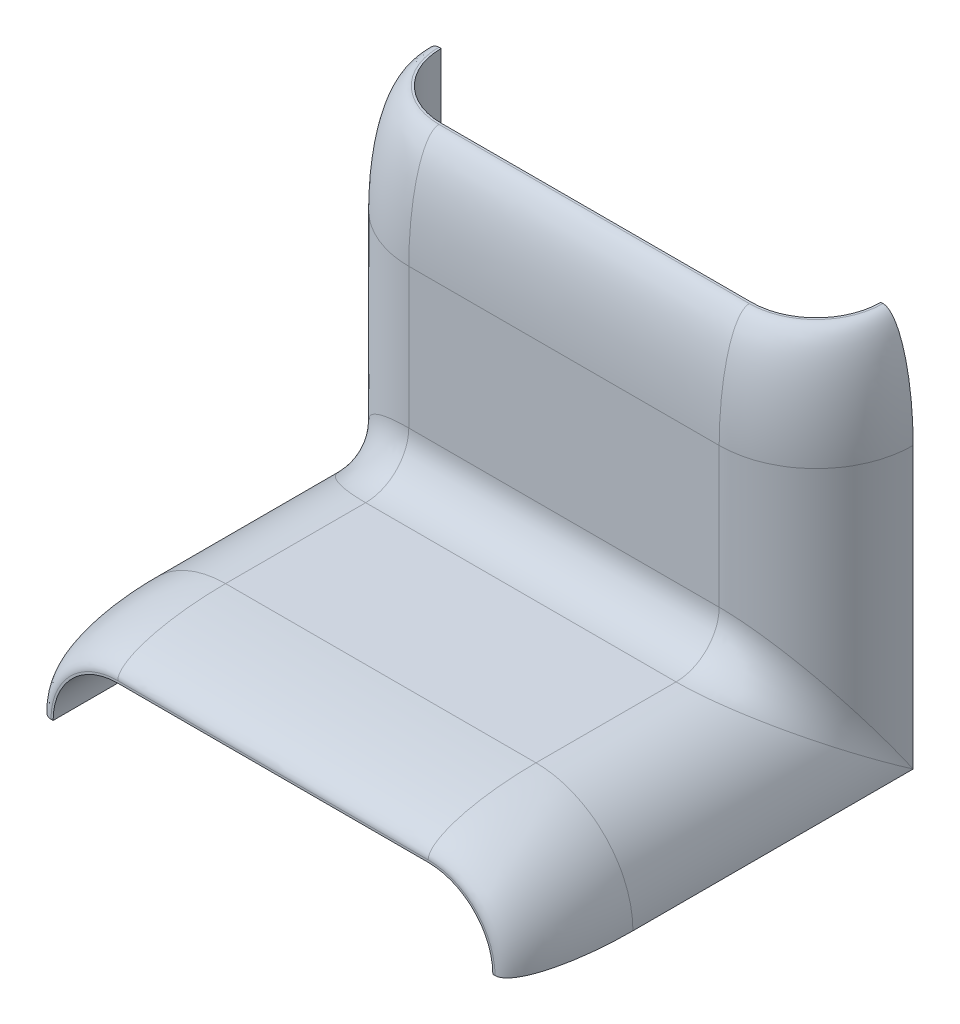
ISO-10303-21;
HEADER;
FILE_DESCRIPTION(('STEP AP214'),'2;1');
FILE_NAME('part.step','',(''),(''),'','','');
FILE_SCHEMA(('AUTOMOTIVE_DESIGN { 1 0 10303 214 1 1 1 1 }'));
ENDSEC;
DATA;
#1=APPLICATION_CONTEXT('core data for automotive mechanical design processes');
#2=APPLICATION_PROTOCOL_DEFINITION('international standard','automotive_design',2000,#1);
#3=PRODUCT_CONTEXT('',#1,'mechanical');
#4=PRODUCT('Part','Part','',(#3));
#5=PRODUCT_RELATED_PRODUCT_CATEGORY('part','',(#4));
#6=PRODUCT_DEFINITION_FORMATION('','',#4);
#7=PRODUCT_DEFINITION_CONTEXT('part definition',#1,'design');
#8=PRODUCT_DEFINITION('design','',#6,#7);
#9=PRODUCT_DEFINITION_SHAPE('','',#8);
#10=(LENGTH_UNIT() NAMED_UNIT(*) SI_UNIT(.MILLI.,.METRE.));
#11=(NAMED_UNIT(*) PLANE_ANGLE_UNIT() SI_UNIT($,.RADIAN.));
#12=(NAMED_UNIT(*) SI_UNIT($,.STERADIAN.) SOLID_ANGLE_UNIT());
#13=UNCERTAINTY_MEASURE_WITH_UNIT(LENGTH_MEASURE(1.E-05),#10,'distance_accuracy_value','');
#14=(GEOMETRIC_REPRESENTATION_CONTEXT(3) GLOBAL_UNCERTAINTY_ASSIGNED_CONTEXT((#13)) GLOBAL_UNIT_ASSIGNED_CONTEXT((#10,
#11,#12)) REPRESENTATION_CONTEXT('',''));
#15=CARTESIAN_POINT('',(0.,0.,0.));
#16=DIRECTION('',(0.,0.,1.));
#17=DIRECTION('',(1.,0.,0.));
#18=AXIS2_PLACEMENT_3D('',#15,#16,#17);
#19=CARTESIAN_POINT('',(7.20000000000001,18.,-18.));
#20=DIRECTION('',(0.,-1.,0.));
#21=DIRECTION('',(1.,0.,0.));
#22=AXIS2_PLACEMENT_3D('',#19,#20,#21);
#23=PLANE('',#22);
#24=CARTESIAN_POINT('',(7.20000000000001,18.,-14.9));
#25=CARTESIAN_POINT('',(2.40000000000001,18.,-14.9));
#26=CARTESIAN_POINT('',(-2.4,18.,-14.9));
#27=CARTESIAN_POINT('',(-7.20000000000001,18.,-14.9));
#28=(BOUNDED_CURVE() B_SPLINE_CURVE(3,(#24,#25,#26,#27),.UNSPECIFIED.,.F.,
.F.) B_SPLINE_CURVE_WITH_KNOTS((4,4),(-0.0144,0.),
.UNSPECIFIED.) CURVE() GEOMETRIC_REPRESENTATION_ITEM() RATIONAL_B_SPLINE_CURVE((1.,1.,1.,1.)) REPRESENTATION_ITEM(''));
#29=CARTESIAN_POINT('',(-7.20000000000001,18.,-14.9));
#30=VERTEX_POINT('',#29);
#31=CARTESIAN_POINT('',(7.20000000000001,18.,-14.9));
#32=VERTEX_POINT('',#31);
#33=EDGE_CURVE('E730',#30,#32,#28,.F.);
#34=ORIENTED_EDGE('',*,*,#33,.T.);
#35=CARTESIAN_POINT('',(10.2904437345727,18.,-18.2432231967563));
#36=CARTESIAN_POINT('',(10.3238807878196,18.,-17.8183651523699));
#37=CARTESIAN_POINT('',(10.2684949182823,18.,-17.3869079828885));
#38=CARTESIAN_POINT('',(9.98930256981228,18.,-16.581784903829));
#39=CARTESIAN_POINT('',(9.76562218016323,18.,-16.2085967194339));
#40=CARTESIAN_POINT('',(9.18717737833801,18.,-15.5828386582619));
#41=CARTESIAN_POINT('',(8.83268936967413,18.,-15.3305677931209));
#42=CARTESIAN_POINT('',(8.05195339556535,18.,-14.9890668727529));
#43=CARTESIAN_POINT('',(7.62617178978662,18.,-14.9000000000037));
#44=CARTESIAN_POINT('',(7.20000000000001,18.,-14.9));
#45=(BOUNDED_CURVE() B_SPLINE_CURVE(3,(#35,#36,#37,#38,#39,#40,#41,#42,#43,#44),.UNSPECIFIED.,
.F.,.F.) B_SPLINE_CURVE_WITH_KNOTS((4,2,2,2,4),(1.49225651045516,1.90459054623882,
2.31692458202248,2.72925861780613,3.14159265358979),
.UNSPECIFIED.) CURVE() GEOMETRIC_REPRESENTATION_ITEM() RATIONAL_B_SPLINE_CURVE((1.,1.,1.,1.,1.,
1.,1.,1.,1.,1.)) REPRESENTATION_ITEM(''));
#46=CARTESIAN_POINT('',(10.2999147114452,18.,-18.));
#47=VERTEX_POINT('',#46);
#48=EDGE_CURVE('E724',#32,#47,#45,.F.);
#49=ORIENTED_EDGE('',*,*,#48,.T.);
#50=DIRECTION('',(1.,0.,0.));
#51=VECTOR('',#50,1.);
#52=CARTESIAN_POINT('',(10.2,18.,-18.));
#53=LINE('',#52,#51);
#54=CARTESIAN_POINT('',(10.2,18.,-18.));
#55=VERTEX_POINT('',#54);
#56=EDGE_CURVE('E194',#55,#47,#53,.T.);
#57=ORIENTED_EDGE('',*,*,#56,.F.);
#58=CARTESIAN_POINT('',(7.20000000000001,18.,-18.));
#59=DIRECTION('',(0.,1.,0.));
#60=DIRECTION('',(1.,0.,0.));
#61=AXIS2_PLACEMENT_3D('',#58,#59,#60);
#62=CIRCLE('',#61,2.99999999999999);
#63=CARTESIAN_POINT('',(7.20000000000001,18.,-15.));
#64=VERTEX_POINT('',#63);
#65=EDGE_CURVE('E190',#64,#55,#62,.T.);
#66=ORIENTED_EDGE('',*,*,#65,.F.);
#67=DIRECTION('',(1.,0.,0.));
#68=VECTOR('',#67,1.);
#69=CARTESIAN_POINT('',(-7.20000000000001,18.,-15.));
#70=LINE('',#69,#68);
#71=CARTESIAN_POINT('',(-7.20000000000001,18.,-15.));
#72=VERTEX_POINT('',#71);
#73=EDGE_CURVE('E430',#72,#64,#70,.T.);
#74=ORIENTED_EDGE('',*,*,#73,.F.);
#75=CARTESIAN_POINT('',(-7.20000000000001,18.,-18.));
#76=DIRECTION('',(0.,1.,0.));
#77=DIRECTION('',(1.,0.,0.));
#78=AXIS2_PLACEMENT_3D('',#75,#76,#77);
#79=CIRCLE('',#78,2.99999999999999);
#80=CARTESIAN_POINT('',(-10.2,18.,-18.));
#81=VERTEX_POINT('',#80);
#82=EDGE_CURVE('E439',#81,#72,#79,.T.);
#83=ORIENTED_EDGE('',*,*,#82,.F.);
#84=DIRECTION('',(1.,0.,0.));
#85=VECTOR('',#84,1.);
#86=CARTESIAN_POINT('',(-11.7,18.,-18.));
#87=LINE('',#86,#85);
#88=CARTESIAN_POINT('',(-10.2999147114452,18.,-18.));
#89=VERTEX_POINT('',#88);
#90=EDGE_CURVE('E857',#89,#81,#87,.T.);
#91=ORIENTED_EDGE('',*,*,#90,.F.);
#92=CARTESIAN_POINT('',(-7.20000000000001,18.,-14.9));
#93=CARTESIAN_POINT('',(-7.62617178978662,18.,-14.9000000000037));
#94=CARTESIAN_POINT('',(-8.05195339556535,18.,-14.9890668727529));
#95=CARTESIAN_POINT('',(-8.83268936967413,18.,-15.3305677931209));
#96=CARTESIAN_POINT('',(-9.18717737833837,18.,-15.5828386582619));
#97=CARTESIAN_POINT('',(-9.76562218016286,18.,-16.2085967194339));
#98=CARTESIAN_POINT('',(-9.98930256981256,18.,-16.5817849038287));
#99=CARTESIAN_POINT('',(-10.2684949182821,18.,-17.3869079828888));
#100=CARTESIAN_POINT('',(-10.3238807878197,18.,-17.8183651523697));
#101=CARTESIAN_POINT('',(-10.2904437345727,18.,-18.2432231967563));
#102=(BOUNDED_CURVE() B_SPLINE_CURVE(3,(#92,#93,#94,#95,#96,#97,#98,#99,#100,#101),
.UNSPECIFIED.,.F.,.F.) B_SPLINE_CURVE_WITH_KNOTS((4,2,2,2,4),(3.14159265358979,3.55392668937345,
3.96626072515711,4.37859476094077,4.79092879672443),
.UNSPECIFIED.) CURVE() GEOMETRIC_REPRESENTATION_ITEM() RATIONAL_B_SPLINE_CURVE((1.,1.,1.,1.,1.,
1.,1.,1.,1.,1.)) REPRESENTATION_ITEM(''));
#103=EDGE_CURVE('E722',#89,#30,#102,.F.);
#104=ORIENTED_EDGE('',*,*,#103,.T.);
#105=EDGE_LOOP('',(#34,#49,#57,#66,#74,#83,#91,#104));
#106=FACE_BOUND('',#105,.T.);
#107=ADVANCED_FACE('F47',(#106),#23,.F.);
#108=CARTESIAN_POINT('',(7.20000000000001,0.,0.));
#109=DIRECTION('',(0.,0.,1.));
#110=DIRECTION('',(1.,0.,0.));
#111=AXIS2_PLACEMENT_3D('',#108,#109,#110);
#112=PLANE('',#111);
#113=DIRECTION('',(1.,0.,0.));
#114=VECTOR('',#113,1.);
#115=CARTESIAN_POINT('',(10.2,0.,0.));
#116=LINE('',#115,#114);
#117=CARTESIAN_POINT('',(10.2,0.,0.));
#118=VERTEX_POINT('',#117);
#119=CARTESIAN_POINT('',(10.2999147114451,0.,0.));
#120=VERTEX_POINT('',#119);
#121=EDGE_CURVE('E208',#118,#120,#116,.T.);
#122=ORIENTED_EDGE('',*,*,#121,.T.);
#123=CARTESIAN_POINT('',(7.20000000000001,3.09999999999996,0.));
#124=CARTESIAN_POINT('',(7.62617178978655,3.09999999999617,0.));
#125=CARTESIAN_POINT('',(8.05195339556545,3.01093312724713,0.));
#126=CARTESIAN_POINT('',(8.83268936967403,2.66943220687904,0.));
#127=CARTESIAN_POINT('',(9.18717737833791,2.41716134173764,0.));
#128=CARTESIAN_POINT('',(9.76562218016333,1.79140328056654,0.));
#129=CARTESIAN_POINT('',(9.98930256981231,1.41821509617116,0.));
#130=CARTESIAN_POINT('',(10.2684949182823,0.613092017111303,0.));
#131=CARTESIAN_POINT('',(10.3238807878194,0.181634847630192,0.));
#132=CARTESIAN_POINT('',(10.2904437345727,-0.243223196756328,0.));
#133=(BOUNDED_CURVE() B_SPLINE_CURVE(3,(#123,#124,#125,#126,#127,#128,#129,#130,#131,#132),
.UNSPECIFIED.,.F.,.F.) B_SPLINE_CURVE_WITH_KNOTS((4,2,2,2,4),(-0.0785398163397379,
0.333794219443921,0.746128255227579,1.15846229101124,1.5707963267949),
.UNSPECIFIED.) CURVE() GEOMETRIC_REPRESENTATION_ITEM() RATIONAL_B_SPLINE_CURVE((1.,1.,1.,1.,1.,
1.,1.,1.,1.,1.)) REPRESENTATION_ITEM(''));
#134=CARTESIAN_POINT('',(7.20000000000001,3.09999999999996,0.));
#135=VERTEX_POINT('',#134);
#136=EDGE_CURVE('E279',#120,#135,#133,.F.);
#137=ORIENTED_EDGE('',*,*,#136,.T.);
#138=CARTESIAN_POINT('',(-7.20000000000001,3.09999999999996,0.));
#139=CARTESIAN_POINT('',(-2.4,3.09999999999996,0.));
#140=CARTESIAN_POINT('',(2.4,3.09999999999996,0.));
#141=CARTESIAN_POINT('',(7.20000000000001,3.09999999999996,0.));
#142=(BOUNDED_CURVE() B_SPLINE_CURVE(3,(#138,#139,#140,#141),.UNSPECIFIED.,.F.,
.F.) B_SPLINE_CURVE_WITH_KNOTS((4,4),(-0.0144,0.),
.UNSPECIFIED.) CURVE() GEOMETRIC_REPRESENTATION_ITEM() RATIONAL_B_SPLINE_CURVE((1.,1.,1.,1.)) REPRESENTATION_ITEM(''));
#143=CARTESIAN_POINT('',(-7.20000000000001,3.09999999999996,0.));
#144=VERTEX_POINT('',#143);
#145=EDGE_CURVE('E244',#135,#144,#142,.F.);
#146=ORIENTED_EDGE('',*,*,#145,.T.);
#147=CARTESIAN_POINT('',(-10.2904437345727,-0.243223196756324,0.));
#148=CARTESIAN_POINT('',(-10.3238807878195,0.181634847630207,0.));
#149=CARTESIAN_POINT('',(-10.2684949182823,0.613092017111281,0.));
#150=CARTESIAN_POINT('',(-9.98930256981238,1.41821509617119,0.));
#151=CARTESIAN_POINT('',(-9.76562218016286,1.79140328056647,0.));
#152=CARTESIAN_POINT('',(-9.18717737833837,2.41716134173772,0.));
#153=CARTESIAN_POINT('',(-8.83268936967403,2.66943220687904,0.));
#154=CARTESIAN_POINT('',(-8.05195339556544,3.01093312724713,0.));
#155=CARTESIAN_POINT('',(-7.62617178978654,3.09999999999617,0.));
#156=CARTESIAN_POINT('',(-7.20000000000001,3.09999999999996,0.));
#157=(BOUNDED_CURVE() B_SPLINE_CURVE(3,(#147,#148,#149,#150,#151,#152,#153,#154,#155,#156),
.UNSPECIFIED.,.F.,.F.) B_SPLINE_CURVE_WITH_KNOTS((4,2,2,2,4),(1.5707963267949,1.98313036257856,
2.39546439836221,2.80779843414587,3.22013246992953),
.UNSPECIFIED.) CURVE() GEOMETRIC_REPRESENTATION_ITEM() RATIONAL_B_SPLINE_CURVE((1.,1.,1.,1.,1.,
1.,1.,1.,1.,1.)) REPRESENTATION_ITEM(''));
#158=CARTESIAN_POINT('',(-10.2999147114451,0.,0.));
#159=VERTEX_POINT('',#158);
#160=EDGE_CURVE('E654',#144,#159,#157,.F.);
#161=ORIENTED_EDGE('',*,*,#160,.T.);
#162=DIRECTION('',(1.,0.,0.));
#163=VECTOR('',#162,1.);
#164=CARTESIAN_POINT('',(-11.7,0.,0.));
#165=LINE('',#164,#163);
#166=CARTESIAN_POINT('',(-10.2,0.,0.));
#167=VERTEX_POINT('',#166);
#168=EDGE_CURVE('E224',#159,#167,#165,.T.);
#169=ORIENTED_EDGE('',*,*,#168,.T.);
#170=CARTESIAN_POINT('',(-7.20000000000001,0.,0.));
#171=DIRECTION('',(0.,0.,-1.));
#172=DIRECTION('',(1.,0.,0.));
#173=AXIS2_PLACEMENT_3D('',#170,#171,#172);
#174=CIRCLE('',#173,2.99999999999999);
#175=CARTESIAN_POINT('',(-7.20000000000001,2.99999999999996,0.));
#176=VERTEX_POINT('',#175);
#177=EDGE_CURVE('E221',#167,#176,#174,.T.);
#178=ORIENTED_EDGE('',*,*,#177,.T.);
#179=DIRECTION('',(1.,0.,0.));
#180=VECTOR('',#179,1.);
#181=CARTESIAN_POINT('',(-7.20000000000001,2.99999999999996,0.));
#182=LINE('',#181,#180);
#183=CARTESIAN_POINT('',(7.20000000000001,2.99999999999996,0.));
#184=VERTEX_POINT('',#183);
#185=EDGE_CURVE('E218',#176,#184,#182,.T.);
#186=ORIENTED_EDGE('',*,*,#185,.T.);
#187=CARTESIAN_POINT('',(7.20000000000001,0.,0.));
#188=DIRECTION('',(0.,0.,-1.));
#189=DIRECTION('',(1.,0.,0.));
#190=AXIS2_PLACEMENT_3D('',#187,#188,#189);
#191=CIRCLE('',#190,2.99999999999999);
#192=EDGE_CURVE('E216',#184,#118,#191,.T.);
#193=ORIENTED_EDGE('',*,*,#192,.T.);
#194=EDGE_LOOP('',(#122,#137,#146,#161,#169,#178,#186,#193));
#195=FACE_BOUND('',#194,.T.);
#196=ADVANCED_FACE('F251',(#195),#112,.T.);
#197=CARTESIAN_POINT('',(7.20000000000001,0.,-18.));
#198=DIRECTION('',(0.,1.,0.));
#199=DIRECTION('',(0.,0.,1.));
#200=AXIS2_PLACEMENT_3D('',#197,#198,#199);
#201=CYLINDRICAL_SURFACE('',#200,4.49999999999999);
#202=DIRECTION('',(0.,1.,0.));
#203=VECTOR('',#202,1.);
#204=CARTESIAN_POINT('',(11.7,0.,-18.));
#205=LINE('',#204,#203);
#206=CARTESIAN_POINT('',(11.7,0.,-18.));
#207=VERTEX_POINT('',#206);
#208=CARTESIAN_POINT('',(11.6999380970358,13.,-18.0000000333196));
#209=VERTEX_POINT('',#208);
#210=EDGE_CURVE('E183',#207,#209,#205,.T.);
#211=ORIENTED_EDGE('',*,*,#210,.T.);
#212=CARTESIAN_POINT('',(7.20000000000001,13.,-13.5));
#213=CARTESIAN_POINT('',(7.81863646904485,13.,-13.5));
#214=CARTESIAN_POINT('',(8.43670654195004,13.,-13.6292906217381));
#215=CARTESIAN_POINT('',(9.57003295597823,13.,-14.1250177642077));
#216=CARTESIAN_POINT('',(10.0846123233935,13.,-14.4912174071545));
#217=CARTESIAN_POINT('',(10.9242902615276,13.,-15.3995758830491));
#218=CARTESIAN_POINT('',(11.2489876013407,13.,-15.9413006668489));
#219=CARTESIAN_POINT('',(11.6542668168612,13.,-17.1100277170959));
#220=CARTESIAN_POINT('',(11.7346656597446,13.,-17.7363365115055));
#221=CARTESIAN_POINT('',(11.6861280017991,13.,-18.3530659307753));
#222=(BOUNDED_CURVE() B_SPLINE_CURVE(3,(#212,#213,#214,#215,#216,#217,#218,#219,#220,#221),
.UNSPECIFIED.,.F.,.F.) B_SPLINE_CURVE_WITH_KNOTS((4,2,2,2,4),(1.49225651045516,1.90459054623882,
2.31692458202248,2.72925861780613,3.14159265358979),
.UNSPECIFIED.) CURVE() GEOMETRIC_REPRESENTATION_ITEM() RATIONAL_B_SPLINE_CURVE((1.,1.,1.,1.,1.,
1.,1.,1.,1.,1.)) REPRESENTATION_ITEM(''));
#223=CARTESIAN_POINT('',(7.20000000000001,13.,-13.5));
#224=VERTEX_POINT('',#223);
#225=EDGE_CURVE('E732',#209,#224,#222,.F.);
#226=ORIENTED_EDGE('',*,*,#225,.T.);
#227=DIRECTION('',(0.,1.,0.));
#228=VECTOR('',#227,1.);
#229=CARTESIAN_POINT('',(7.20000000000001,0.,-13.5));
#230=LINE('',#229,#228);
#231=CARTESIAN_POINT('',(7.20000000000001,6.49999999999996,-13.5));
#232=VERTEX_POINT('',#231);
#233=EDGE_CURVE('E354',#232,#224,#230,.T.);
#234=ORIENTED_EDGE('',*,*,#233,.F.);
#235=CARTESIAN_POINT('',(7.20000000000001,0.,-18.));
#236=DIRECTION('',(0.,-0.569209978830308,0.822192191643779));
#237=DIRECTION('',(0.,0.822192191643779,0.569209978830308));
#238=AXIS2_PLACEMENT_3D('',#235,#236,#237);
#239=ELLIPSE('',#238,7.90569415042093,4.49999999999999);
#240=EDGE_CURVE('E752',#232,#207,#239,.F.);
#241=ORIENTED_EDGE('',*,*,#240,.T.);
#242=EDGE_LOOP('',(#211,#226,#234,#241));
#243=FACE_BOUND('',#242,.T.);
#244=ADVANCED_FACE('F261',(#243),#201,.T.);
#245=CARTESIAN_POINT('',(-7.20000000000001,0.,-13.5));
#246=DIRECTION('',(0.,0.,-1.));
#247=DIRECTION('',(-1.,0.,0.));
#248=AXIS2_PLACEMENT_3D('',#245,#246,#247);
#249=PLANE('',#248);
#250=ORIENTED_EDGE('',*,*,#233,.T.);
#251=CARTESIAN_POINT('',(-7.20000000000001,13.,-13.5));
#252=CARTESIAN_POINT('',(-2.4,13.,-13.5));
#253=CARTESIAN_POINT('',(2.40000000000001,13.,-13.5));
#254=CARTESIAN_POINT('',(7.20000000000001,13.,-13.5));
#255=(BOUNDED_CURVE() B_SPLINE_CURVE(3,(#251,#252,#253,#254),.UNSPECIFIED.,.F.,
.F.) B_SPLINE_CURVE_WITH_KNOTS((4,4),(-0.0144,0.),
.UNSPECIFIED.) CURVE() GEOMETRIC_REPRESENTATION_ITEM() RATIONAL_B_SPLINE_CURVE((1.,1.,1.,1.)) REPRESENTATION_ITEM(''));
#256=CARTESIAN_POINT('',(-7.20000000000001,13.,-13.5));
#257=VERTEX_POINT('',#256);
#258=EDGE_CURVE('E672',#224,#257,#255,.F.);
#259=ORIENTED_EDGE('',*,*,#258,.T.);
#260=DIRECTION('',(0.,1.,0.));
#261=VECTOR('',#260,1.);
#262=CARTESIAN_POINT('',(-7.20000000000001,0.,-13.5));
#263=LINE('',#262,#261);
#264=CARTESIAN_POINT('',(-7.20000000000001,6.49999999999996,-13.5));
#265=VERTEX_POINT('',#264);
#266=EDGE_CURVE('E446',#265,#257,#263,.T.);
#267=ORIENTED_EDGE('',*,*,#266,.F.);
#268=DIRECTION('',(1.,0.,0.));
#269=VECTOR('',#268,1.);
#270=CARTESIAN_POINT('',(7.20000000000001,6.49999999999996,-13.5));
#271=LINE('',#270,#269);
#272=EDGE_CURVE('E743',#265,#232,#271,.T.);
#273=ORIENTED_EDGE('',*,*,#272,.T.);
#274=EDGE_LOOP('',(#250,#259,#267,#273));
#275=FACE_BOUND('',#274,.T.);
#276=ADVANCED_FACE('F761',(#275),#249,.F.);
#277=CARTESIAN_POINT('',(-7.20000000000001,0.,-18.));
#278=DIRECTION('',(0.,1.,0.));
#279=DIRECTION('',(0.,0.,1.));
#280=AXIS2_PLACEMENT_3D('',#277,#278,#279);
#281=CYLINDRICAL_SURFACE('',#280,4.49999999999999);
#282=ORIENTED_EDGE('',*,*,#266,.T.);
#283=CARTESIAN_POINT('',(-11.6861280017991,13.,-18.3530659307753));
#284=CARTESIAN_POINT('',(-11.7346656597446,13.,-17.7363365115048));
#285=CARTESIAN_POINT('',(-11.6542668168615,13.,-17.1100277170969));
#286=CARTESIAN_POINT('',(-11.2489876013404,13.,-15.9413006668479));
#287=CARTESIAN_POINT('',(-10.9242902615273,13.,-15.3995758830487));
#288=CARTESIAN_POINT('',(-10.0846123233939,13.,-14.4912174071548));
#289=CARTESIAN_POINT('',(-9.57003295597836,13.,-14.1250177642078));
#290=CARTESIAN_POINT('',(-8.4367065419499,13.,-13.629290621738));
#291=CARTESIAN_POINT('',(-7.81863646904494,13.,-13.5));
#292=CARTESIAN_POINT('',(-7.20000000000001,13.,-13.5));
#293=(BOUNDED_CURVE() B_SPLINE_CURVE(3,(#283,#284,#285,#286,#287,#288,#289,#290,#291,#292),
.UNSPECIFIED.,.F.,.F.) B_SPLINE_CURVE_WITH_KNOTS((4,2,2,2,4),(3.14159265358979,3.55392668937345,
3.96626072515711,4.37859476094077,4.79092879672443),
.UNSPECIFIED.) CURVE() GEOMETRIC_REPRESENTATION_ITEM() RATIONAL_B_SPLINE_CURVE((1.,1.,1.,1.,1.,
1.,1.,1.,1.,1.)) REPRESENTATION_ITEM(''));
#294=CARTESIAN_POINT('',(-11.6999380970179,13.,-18.));
#295=VERTEX_POINT('',#294);
#296=EDGE_CURVE('E456',#257,#295,#293,.F.);
#297=ORIENTED_EDGE('',*,*,#296,.T.);
#298=DIRECTION('',(0.,1.,0.));
#299=VECTOR('',#298,1.);
#300=CARTESIAN_POINT('',(-11.7,0.,-18.));
#301=LINE('',#300,#299);
#302=CARTESIAN_POINT('',(-11.7,0.,-18.));
#303=VERTEX_POINT('',#302);
#304=EDGE_CURVE('E450',#303,#295,#301,.T.);
#305=ORIENTED_EDGE('',*,*,#304,.F.);
#306=CARTESIAN_POINT('',(-7.20000000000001,0.,-18.));
#307=DIRECTION('',(0.,-0.569209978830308,0.822192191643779));
#308=DIRECTION('',(0.,0.822192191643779,0.569209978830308));
#309=AXIS2_PLACEMENT_3D('',#306,#307,#308);
#310=ELLIPSE('',#309,7.90569415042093,4.49999999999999);
#311=EDGE_CURVE('E238',#303,#265,#310,.F.);
#312=ORIENTED_EDGE('',*,*,#311,.T.);
#313=EDGE_LOOP('',(#282,#297,#305,#312));
#314=FACE_BOUND('',#313,.T.);
#315=ADVANCED_FACE('F262',(#314),#281,.T.);
#316=CARTESIAN_POINT('',(-11.7,0.,-18.));
#317=DIRECTION('',(0.,0.,1.));
#318=DIRECTION('',(1.,0.,0.));
#319=AXIS2_PLACEMENT_3D('',#316,#317,#318);
#320=PLANE('',#319);
#321=ORIENTED_EDGE('',*,*,#304,.T.);
#322=CARTESIAN_POINT('',(-10.2999147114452,18.,-17.9999999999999));
#323=CARTESIAN_POINT('',(-11.6998761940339,18.,-17.9999999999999));
#324=CARTESIAN_POINT('',(-11.6998761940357,13.,-18.0000000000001));
#325=(BOUNDED_CURVE() B_SPLINE_CURVE(2,(#322,#323,#324),.UNSPECIFIED.,.F.,
.F.) B_SPLINE_CURVE_WITH_KNOTS((3,3),(0.,1.),
.UNSPECIFIED.) CURVE() GEOMETRIC_REPRESENTATION_ITEM() RATIONAL_B_SPLINE_CURVE((1.,
0.707106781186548,1.)) REPRESENTATION_ITEM(''));
#326=EDGE_CURVE('E469',#295,#89,#325,.F.);
#327=ORIENTED_EDGE('',*,*,#326,.T.);
#328=ORIENTED_EDGE('',*,*,#90,.T.);
#329=DIRECTION('',(0.,1.,0.));
#330=VECTOR('',#329,1.);
#331=CARTESIAN_POINT('',(-10.2,0.,-18.));
#332=LINE('',#331,#330);
#333=CARTESIAN_POINT('',(-10.2,0.,-18.));
#334=VERTEX_POINT('',#333);
#335=EDGE_CURVE('E865',#334,#81,#332,.T.);
#336=ORIENTED_EDGE('',*,*,#335,.F.);
#337=DIRECTION('',(1.,0.,0.));
#338=VECTOR('',#337,1.);
#339=CARTESIAN_POINT('',(-11.7,0.,-18.));
#340=LINE('',#339,#338);
#341=EDGE_CURVE('E228',#303,#334,#340,.T.);
#342=ORIENTED_EDGE('',*,*,#341,.F.);
#343=EDGE_LOOP('',(#321,#327,#328,#336,#342));
#344=FACE_BOUND('',#343,.T.);
#345=ADVANCED_FACE('F475',(#344),#320,.F.);
#346=CARTESIAN_POINT('',(-7.20000000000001,0.,-18.));
#347=DIRECTION('',(0.,1.,0.));
#348=DIRECTION('',(0.,0.,1.));
#349=AXIS2_PLACEMENT_3D('',#346,#347,#348);
#350=CYLINDRICAL_SURFACE('',#349,2.99999999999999);
#351=CARTESIAN_POINT('',(-7.20000000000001,0.,-18.));
#352=DIRECTION('',(0.,0.707106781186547,-0.707106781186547));
#353=DIRECTION('',(0.,-0.707106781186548,-0.707106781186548));
#354=AXIS2_PLACEMENT_3D('',#351,#352,#353);
#355=ELLIPSE('',#354,4.24264068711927,2.99999999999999);
#356=CARTESIAN_POINT('',(-7.20000000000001,2.99999999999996,-15.));
#357=VERTEX_POINT('',#356);
#358=EDGE_CURVE('E204',#357,#334,#355,.F.);
#359=ORIENTED_EDGE('',*,*,#358,.T.);
#360=ORIENTED_EDGE('',*,*,#335,.T.);
#361=ORIENTED_EDGE('',*,*,#82,.T.);
#362=DIRECTION('',(0.,1.,0.));
#363=VECTOR('',#362,1.);
#364=CARTESIAN_POINT('',(-7.20000000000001,0.,-15.));
#365=LINE('',#364,#363);
#366=EDGE_CURVE('E432',#357,#72,#365,.T.);
#367=ORIENTED_EDGE('',*,*,#366,.F.);
#368=EDGE_LOOP('',(#359,#360,#361,#367));
#369=FACE_BOUND('',#368,.T.);
#370=ADVANCED_FACE('F484',(#369),#350,.F.);
#371=CARTESIAN_POINT('',(-7.20000000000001,0.,-15.));
#372=DIRECTION('',(0.,0.,1.));
#373=DIRECTION('',(1.,0.,0.));
#374=AXIS2_PLACEMENT_3D('',#371,#372,#373);
#375=PLANE('',#374);
#376=CARTESIAN_POINT('',(0.,11.,-15.));
#377=DIRECTION('',(0.,0.,1.));
#378=DIRECTION('',(1.,0.,0.));
#379=AXIS2_PLACEMENT_3D('',#376,#377,#378);
#380=CIRCLE('',#379,2.4);
#381=CARTESIAN_POINT('',(2.4,11.,-15.));
#382=VERTEX_POINT('',#381);
#383=EDGE_CURVE('E668',#382,#382,#380,.F.);
#384=ORIENTED_EDGE('',*,*,#383,.F.);
#385=EDGE_LOOP('',(#384));
#386=FACE_BOUND('',#385,.T.);
#387=DIRECTION('',(-1.,0.,0.));
#388=VECTOR('',#387,1.);
#389=CARTESIAN_POINT('',(-7.20000000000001,2.99999999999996,-15.));
#390=LINE('',#389,#388);
#391=CARTESIAN_POINT('',(7.20000000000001,2.99999999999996,-15.));
#392=VERTEX_POINT('',#391);
#393=EDGE_CURVE('E182',#392,#357,#390,.T.);
#394=ORIENTED_EDGE('',*,*,#393,.T.);
#395=ORIENTED_EDGE('',*,*,#366,.T.);
#396=ORIENTED_EDGE('',*,*,#73,.T.);
#397=DIRECTION('',(0.,1.,0.));
#398=VECTOR('',#397,1.);
#399=CARTESIAN_POINT('',(7.20000000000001,0.,-15.));
#400=LINE('',#399,#398);
#401=EDGE_CURVE('E427',#392,#64,#400,.T.);
#402=ORIENTED_EDGE('',*,*,#401,.F.);
#403=EDGE_LOOP('',(#394,#395,#396,#402));
#404=FACE_BOUND('',#403,.T.);
#405=ADVANCED_FACE('F428',(#386,#404),#375,.F.);
#406=CARTESIAN_POINT('',(7.20000000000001,0.,-18.));
#407=DIRECTION('',(0.,1.,0.));
#408=DIRECTION('',(0.,0.,1.));
#409=AXIS2_PLACEMENT_3D('',#406,#407,#408);
#410=CYLINDRICAL_SURFACE('',#409,2.99999999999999);
#411=CARTESIAN_POINT('',(7.20000000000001,0.,-18.));
#412=DIRECTION('',(0.,0.707106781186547,-0.707106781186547));
#413=DIRECTION('',(0.,-0.707106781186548,-0.707106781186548));
#414=AXIS2_PLACEMENT_3D('',#411,#412,#413);
#415=ELLIPSE('',#414,4.24264068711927,2.99999999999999);
#416=CARTESIAN_POINT('',(10.2,0.,-18.));
#417=VERTEX_POINT('',#416);
#418=EDGE_CURVE('E173',#417,#392,#415,.F.);
#419=ORIENTED_EDGE('',*,*,#418,.T.);
#420=ORIENTED_EDGE('',*,*,#401,.T.);
#421=ORIENTED_EDGE('',*,*,#65,.T.);
#422=DIRECTION('',(0.,1.,0.));
#423=VECTOR('',#422,1.);
#424=CARTESIAN_POINT('',(10.2,0.,-18.));
#425=LINE('',#424,#423);
#426=EDGE_CURVE('E186',#417,#55,#425,.T.);
#427=ORIENTED_EDGE('',*,*,#426,.F.);
#428=EDGE_LOOP('',(#419,#420,#421,#427));
#429=FACE_BOUND('',#428,.T.);
#430=ADVANCED_FACE('F188',(#429),#410,.F.);
#431=CARTESIAN_POINT('',(10.2,0.,-18.));
#432=DIRECTION('',(0.,0.,1.));
#433=DIRECTION('',(1.,0.,0.));
#434=AXIS2_PLACEMENT_3D('',#431,#432,#433);
#435=PLANE('',#434);
#436=ORIENTED_EDGE('',*,*,#56,.T.);
#437=CARTESIAN_POINT('',(11.6998761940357,13.,-18.0000000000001));
#438=CARTESIAN_POINT('',(11.6998761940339,18.,-18.));
#439=CARTESIAN_POINT('',(10.2999147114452,18.,-17.9999999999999));
#440=(BOUNDED_CURVE() B_SPLINE_CURVE(2,(#437,#438,#439),.UNSPECIFIED.,.F.,
.F.) B_SPLINE_CURVE_WITH_KNOTS((3,3),(0.,1.),
.UNSPECIFIED.) CURVE() GEOMETRIC_REPRESENTATION_ITEM() RATIONAL_B_SPLINE_CURVE((1.,
0.707106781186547,1.)) REPRESENTATION_ITEM(''));
#441=EDGE_CURVE('E723',#47,#209,#440,.F.);
#442=ORIENTED_EDGE('',*,*,#441,.T.);
#443=ORIENTED_EDGE('',*,*,#210,.F.);
#444=DIRECTION('',(1.,0.,0.));
#445=VECTOR('',#444,1.);
#446=CARTESIAN_POINT('',(10.2,0.,-18.));
#447=LINE('',#446,#445);
#448=EDGE_CURVE('E198',#417,#207,#447,.T.);
#449=ORIENTED_EDGE('',*,*,#448,.F.);
#450=ORIENTED_EDGE('',*,*,#426,.T.);
#451=EDGE_LOOP('',(#436,#442,#443,#449,#450));
#452=FACE_BOUND('',#451,.T.);
#453=ADVANCED_FACE('F199',(#452),#435,.F.);
#454=CARTESIAN_POINT('',(-11.7,0.,0.));
#455=DIRECTION('',(0.,1.,0.));
#456=DIRECTION('',(0.,0.,1.));
#457=AXIS2_PLACEMENT_3D('',#454,#455,#456);
#458=PLANE('',#457);
#459=ORIENTED_EDGE('',*,*,#168,.F.);
#460=CARTESIAN_POINT('',(-11.6998761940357,0.,-5.));
#461=CARTESIAN_POINT('',(-11.6998761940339,0.,0.));
#462=CARTESIAN_POINT('',(-10.2999147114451,0.,0.));
#463=(BOUNDED_CURVE() B_SPLINE_CURVE(2,(#460,#461,#462),.UNSPECIFIED.,.F.,
.F.) B_SPLINE_CURVE_WITH_KNOTS((3,3),(0.,1.),
.UNSPECIFIED.) CURVE() GEOMETRIC_REPRESENTATION_ITEM() RATIONAL_B_SPLINE_CURVE((1.,
0.707106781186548,1.)) REPRESENTATION_ITEM(''));
#464=CARTESIAN_POINT('',(-11.6999380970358,-3.33195942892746E-08,-5.));
#465=VERTEX_POINT('',#464);
#466=EDGE_CURVE('E75',#159,#465,#463,.F.);
#467=ORIENTED_EDGE('',*,*,#466,.T.);
#468=DIRECTION('',(0.,0.,-1.));
#469=VECTOR('',#468,1.);
#470=CARTESIAN_POINT('',(-11.7,0.,0.));
#471=LINE('',#470,#469);
#472=EDGE_CURVE('E230',#465,#303,#471,.T.);
#473=ORIENTED_EDGE('',*,*,#472,.T.);
#474=ORIENTED_EDGE('',*,*,#341,.T.);
#475=DIRECTION('',(0.,0.,-1.));
#476=VECTOR('',#475,1.);
#477=CARTESIAN_POINT('',(-10.2,0.,0.));
#478=LINE('',#477,#476);
#479=EDGE_CURVE('E225',#167,#334,#478,.T.);
#480=ORIENTED_EDGE('',*,*,#479,.F.);
#481=EDGE_LOOP('',(#459,#467,#473,#474,#480));
#482=FACE_BOUND('',#481,.T.);
#483=ADVANCED_FACE('F403',(#482),#458,.F.);
#484=CARTESIAN_POINT('',(10.2,0.,0.));
#485=DIRECTION('',(0.,1.,0.));
#486=DIRECTION('',(0.,0.,1.));
#487=AXIS2_PLACEMENT_3D('',#484,#485,#486);
#488=PLANE('',#487);
#489=DIRECTION('',(0.,0.,-1.));
#490=VECTOR('',#489,1.);
#491=CARTESIAN_POINT('',(11.7,0.,0.));
#492=LINE('',#491,#490);
#493=CARTESIAN_POINT('',(11.6999380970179,0.,-5.));
#494=VERTEX_POINT('',#493);
#495=EDGE_CURVE('E283',#494,#207,#492,.T.);
#496=ORIENTED_EDGE('',*,*,#495,.F.);
#497=CARTESIAN_POINT('',(10.2999147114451,0.,0.));
#498=CARTESIAN_POINT('',(11.6998761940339,0.,0.));
#499=CARTESIAN_POINT('',(11.6998761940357,0.,-5.));
#500=(BOUNDED_CURVE() B_SPLINE_CURVE(2,(#497,#498,#499),.UNSPECIFIED.,.F.,
.F.) B_SPLINE_CURVE_WITH_KNOTS((3,3),(0.,1.),
.UNSPECIFIED.) CURVE() GEOMETRIC_REPRESENTATION_ITEM() RATIONAL_B_SPLINE_CURVE((1.,
0.707106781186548,1.)) REPRESENTATION_ITEM(''));
#501=EDGE_CURVE('E390',#494,#120,#500,.F.);
#502=ORIENTED_EDGE('',*,*,#501,.T.);
#503=ORIENTED_EDGE('',*,*,#121,.F.);
#504=DIRECTION('',(0.,0.,-1.));
#505=VECTOR('',#504,1.);
#506=CARTESIAN_POINT('',(10.2,0.,0.));
#507=LINE('',#506,#505);
#508=EDGE_CURVE('E177',#118,#417,#507,.T.);
#509=ORIENTED_EDGE('',*,*,#508,.T.);
#510=ORIENTED_EDGE('',*,*,#448,.T.);
#511=EDGE_LOOP('',(#496,#502,#503,#509,#510));
#512=FACE_BOUND('',#511,.T.);
#513=ADVANCED_FACE('F206',(#512),#488,.F.);
#514=CARTESIAN_POINT('',(7.20000000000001,0.,0.));
#515=DIRECTION('',(0.,0.,-1.));
#516=DIRECTION('',(-1.,0.,0.));
#517=AXIS2_PLACEMENT_3D('',#514,#515,#516);
#518=CYLINDRICAL_SURFACE('',#517,4.49999999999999);
#519=DIRECTION('',(0.,0.,-1.));
#520=VECTOR('',#519,1.);
#521=CARTESIAN_POINT('',(7.20000000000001,4.49999999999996,0.));
#522=LINE('',#521,#520);
#523=CARTESIAN_POINT('',(7.20000000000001,4.49999999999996,-5.));
#524=VERTEX_POINT('',#523);
#525=CARTESIAN_POINT('',(7.20000000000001,4.49999999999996,-11.5));
#526=VERTEX_POINT('',#525);
#527=EDGE_CURVE('E290',#524,#526,#522,.T.);
#528=ORIENTED_EDGE('',*,*,#527,.F.);
#529=CARTESIAN_POINT('',(11.6861280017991,-0.353065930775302,-5.));
#530=CARTESIAN_POINT('',(11.7346656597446,0.263663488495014,-5.));
#531=CARTESIAN_POINT('',(11.6542668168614,0.889972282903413,-5.));
#532=CARTESIAN_POINT('',(11.2489876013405,2.05869933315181,-5.));
#533=CARTESIAN_POINT('',(10.9242902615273,2.60042411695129,-5.));
#534=CARTESIAN_POINT('',(10.0846123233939,3.50878259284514,-5.));
#535=CARTESIAN_POINT('',(9.57003295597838,3.8749822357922,-5.));
#536=CARTESIAN_POINT('',(8.43670654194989,4.37070937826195,-5.));
#537=CARTESIAN_POINT('',(7.81863646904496,4.49999999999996,-5.));
#538=CARTESIAN_POINT('',(7.20000000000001,4.49999999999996,-5.));
#539=(BOUNDED_CURVE() B_SPLINE_CURVE(3,(#529,#530,#531,#532,#533,#534,#535,#536,#537,#538),
.UNSPECIFIED.,.F.,.F.) B_SPLINE_CURVE_WITH_KNOTS((4,2,2,2,4),(-0.0785398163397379,
0.333794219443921,0.746128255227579,1.15846229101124,1.5707963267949),
.UNSPECIFIED.) CURVE() GEOMETRIC_REPRESENTATION_ITEM() RATIONAL_B_SPLINE_CURVE((1.,1.,1.,1.,1.,
1.,1.,1.,1.,1.)) REPRESENTATION_ITEM(''));
#540=EDGE_CURVE('E651',#524,#494,#539,.F.);
#541=ORIENTED_EDGE('',*,*,#540,.T.);
#542=ORIENTED_EDGE('',*,*,#495,.T.);
#543=CARTESIAN_POINT('',(7.20000000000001,0.,-18.));
#544=DIRECTION('',(0.,-0.822192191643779,0.569209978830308));
#545=DIRECTION('',(0.,0.569209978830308,0.822192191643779));
#546=AXIS2_PLACEMENT_3D('',#543,#544,#545);
#547=ELLIPSE('',#546,7.90569415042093,4.49999999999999);
#548=EDGE_CURVE('E747',#207,#526,#547,.T.);
#549=ORIENTED_EDGE('',*,*,#548,.T.);
#550=EDGE_LOOP('',(#528,#541,#542,#549));
#551=FACE_BOUND('',#550,.T.);
#552=ADVANCED_FACE('F372',(#551),#518,.T.);
#553=CARTESIAN_POINT('',(-7.20000000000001,4.49999999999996,0.));
#554=DIRECTION('',(0.,-1.,0.));
#555=DIRECTION('',(0.,0.,-1.));
#556=AXIS2_PLACEMENT_3D('',#553,#554,#555);
#557=PLANE('',#556);
#558=DIRECTION('',(0.,0.,-1.));
#559=VECTOR('',#558,1.);
#560=CARTESIAN_POINT('',(-7.20000000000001,4.49999999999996,0.));
#561=LINE('',#560,#559);
#562=CARTESIAN_POINT('',(-7.20000000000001,4.49999999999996,-5.));
#563=VERTEX_POINT('',#562);
#564=CARTESIAN_POINT('',(-7.20000000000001,4.49999999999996,-11.5));
#565=VERTEX_POINT('',#564);
#566=EDGE_CURVE('E306',#563,#565,#561,.T.);
#567=ORIENTED_EDGE('',*,*,#566,.F.);
#568=CARTESIAN_POINT('',(7.20000000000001,4.49999999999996,-5.));
#569=CARTESIAN_POINT('',(2.4,4.49999999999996,-5.));
#570=CARTESIAN_POINT('',(-2.4,4.49999999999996,-5.));
#571=CARTESIAN_POINT('',(-7.20000000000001,4.49999999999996,-5.));
#572=(BOUNDED_CURVE() B_SPLINE_CURVE(3,(#568,#569,#570,#571),.UNSPECIFIED.,.F.,
.F.) B_SPLINE_CURVE_WITH_KNOTS((4,4),(-0.0144,0.),
.UNSPECIFIED.) CURVE() GEOMETRIC_REPRESENTATION_ITEM() RATIONAL_B_SPLINE_CURVE((1.,1.,1.,1.)) REPRESENTATION_ITEM(''));
#573=EDGE_CURVE('E12',#563,#524,#572,.F.);
#574=ORIENTED_EDGE('',*,*,#573,.T.);
#575=ORIENTED_EDGE('',*,*,#527,.T.);
#576=DIRECTION('',(1.,0.,0.));
#577=VECTOR('',#576,1.);
#578=CARTESIAN_POINT('',(-7.20000000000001,4.49999999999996,-11.5));
#579=LINE('',#578,#577);
#580=EDGE_CURVE('E736',#526,#565,#579,.F.);
#581=ORIENTED_EDGE('',*,*,#580,.T.);
#582=EDGE_LOOP('',(#567,#574,#575,#581));
#583=FACE_BOUND('',#582,.T.);
#584=ADVANCED_FACE('F328',(#583),#557,.F.);
#585=CARTESIAN_POINT('',(-7.20000000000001,0.,0.));
#586=DIRECTION('',(0.,0.,-1.));
#587=DIRECTION('',(-1.,0.,0.));
#588=AXIS2_PLACEMENT_3D('',#585,#586,#587);
#589=CYLINDRICAL_SURFACE('',#588,4.49999999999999);
#590=ORIENTED_EDGE('',*,*,#472,.F.);
#591=CARTESIAN_POINT('',(-7.20000000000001,4.49999999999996,-5.));
#592=CARTESIAN_POINT('',(-7.81863646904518,4.49999999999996,-5.));
#593=CARTESIAN_POINT('',(-8.43670654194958,4.37070937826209,-5.));
#594=CARTESIAN_POINT('',(-9.57003295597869,3.87498223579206,-5.));
#595=CARTESIAN_POINT('',(-10.0846123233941,3.50878259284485,-5.));
#596=CARTESIAN_POINT('',(-10.924290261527,2.60042411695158,-5.));
#597=CARTESIAN_POINT('',(-11.2489876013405,2.05869933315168,-5.));
#598=CARTESIAN_POINT('',(-11.6542668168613,0.889972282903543,-5.));
#599=CARTESIAN_POINT('',(-11.7346656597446,0.263663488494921,-5.));
#600=CARTESIAN_POINT('',(-11.6861280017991,-0.353065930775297,-5.));
#601=(BOUNDED_CURVE() B_SPLINE_CURVE(3,(#591,#592,#593,#594,#595,#596,#597,#598,#599,#600),
.UNSPECIFIED.,.F.,.F.) B_SPLINE_CURVE_WITH_KNOTS((4,2,2,2,4),(1.5707963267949,1.98313036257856,
2.39546439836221,2.80779843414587,3.22013246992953),
.UNSPECIFIED.) CURVE() GEOMETRIC_REPRESENTATION_ITEM() RATIONAL_B_SPLINE_CURVE((1.,1.,1.,1.,1.,
1.,1.,1.,1.,1.)) REPRESENTATION_ITEM(''));
#602=EDGE_CURVE('E60',#465,#563,#601,.F.);
#603=ORIENTED_EDGE('',*,*,#602,.T.);
#604=ORIENTED_EDGE('',*,*,#566,.T.);
#605=CARTESIAN_POINT('',(-7.20000000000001,0.,-18.));
#606=DIRECTION('',(0.,-0.822192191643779,0.569209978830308));
#607=DIRECTION('',(0.,0.569209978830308,0.822192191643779));
#608=AXIS2_PLACEMENT_3D('',#605,#606,#607);
#609=ELLIPSE('',#608,7.90569415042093,4.49999999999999);
#610=EDGE_CURVE('E754',#565,#303,#609,.T.);
#611=ORIENTED_EDGE('',*,*,#610,.T.);
#612=EDGE_LOOP('',(#590,#603,#604,#611));
#613=FACE_BOUND('',#612,.T.);
#614=ADVANCED_FACE('F317',(#613),#589,.T.);
#615=CARTESIAN_POINT('',(-7.20000000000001,0.,0.));
#616=DIRECTION('',(0.,0.,-1.));
#617=DIRECTION('',(-1.,0.,0.));
#618=AXIS2_PLACEMENT_3D('',#615,#616,#617);
#619=CYLINDRICAL_SURFACE('',#618,2.99999999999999);
#620=DIRECTION('',(0.,0.,-1.));
#621=VECTOR('',#620,1.);
#622=CARTESIAN_POINT('',(-7.20000000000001,2.99999999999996,0.));
#623=LINE('',#622,#621);
#624=EDGE_CURVE('E211',#176,#357,#623,.T.);
#625=ORIENTED_EDGE('',*,*,#624,.F.);
#626=ORIENTED_EDGE('',*,*,#177,.F.);
#627=ORIENTED_EDGE('',*,*,#479,.T.);
#628=ORIENTED_EDGE('',*,*,#358,.F.);
#629=EDGE_LOOP('',(#625,#626,#627,#628));
#630=FACE_BOUND('',#629,.T.);
#631=ADVANCED_FACE('F327',(#630),#619,.F.);
#632=CARTESIAN_POINT('',(-7.20000000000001,2.99999999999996,0.));
#633=DIRECTION('',(0.,1.,0.));
#634=DIRECTION('',(0.,0.,1.));
#635=AXIS2_PLACEMENT_3D('',#632,#633,#634);
#636=PLANE('',#635);
#637=CARTESIAN_POINT('',(0.,2.99999999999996,-7.));
#638=DIRECTION('',(0.,1.,0.));
#639=DIRECTION('',(0.,0.,1.));
#640=AXIS2_PLACEMENT_3D('',#637,#638,#639);
#641=CIRCLE('',#640,2.4);
#642=CARTESIAN_POINT('',(0.,2.99999999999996,-4.6));
#643=VERTEX_POINT('',#642);
#644=EDGE_CURVE('E422',#643,#643,#641,.F.);
#645=ORIENTED_EDGE('',*,*,#644,.F.);
#646=EDGE_LOOP('',(#645));
#647=FACE_BOUND('',#646,.T.);
#648=DIRECTION('',(0.,0.,-1.));
#649=VECTOR('',#648,1.);
#650=CARTESIAN_POINT('',(7.20000000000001,2.99999999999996,0.));
#651=LINE('',#650,#649);
#652=EDGE_CURVE('E179',#184,#392,#651,.T.);
#653=ORIENTED_EDGE('',*,*,#652,.F.);
#654=ORIENTED_EDGE('',*,*,#185,.F.);
#655=ORIENTED_EDGE('',*,*,#624,.T.);
#656=ORIENTED_EDGE('',*,*,#393,.F.);
#657=EDGE_LOOP('',(#653,#654,#655,#656));
#658=FACE_BOUND('',#657,.T.);
#659=ADVANCED_FACE('F410',(#647,#658),#636,.F.);
#660=CARTESIAN_POINT('',(7.20000000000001,0.,0.));
#661=DIRECTION('',(0.,0.,-1.));
#662=DIRECTION('',(-1.,0.,0.));
#663=AXIS2_PLACEMENT_3D('',#660,#661,#662);
#664=CYLINDRICAL_SURFACE('',#663,2.99999999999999);
#665=ORIENTED_EDGE('',*,*,#508,.F.);
#666=ORIENTED_EDGE('',*,*,#192,.F.);
#667=ORIENTED_EDGE('',*,*,#652,.T.);
#668=ORIENTED_EDGE('',*,*,#418,.F.);
#669=EDGE_LOOP('',(#665,#666,#667,#668));
#670=FACE_BOUND('',#669,.T.);
#671=ADVANCED_FACE('F175',(#670),#664,.F.);
#672=CARTESIAN_POINT('',(2.70000000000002,0.,-18.));
#673=CARTESIAN_POINT('',(2.70000000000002,0.,-18.));
#674=CARTESIAN_POINT('',(2.70000000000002,0.,-18.));
#675=CARTESIAN_POINT('',(2.70000564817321,0.141613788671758,-17.9019596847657));
#676=CARTESIAN_POINT('',(2.69998775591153,0.119826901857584,-17.8801730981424));
#677=CARTESIAN_POINT('',(2.70000564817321,0.0980403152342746,-17.8583862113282));
#678=CARTESIAN_POINT('',(2.70320387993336,0.283207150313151,-17.8039335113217));
#679=CARTESIAN_POINT('',(2.70463224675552,0.239721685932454,-17.7602783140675));
#680=CARTESIAN_POINT('',(2.70320387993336,0.196066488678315,-17.7167928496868));
#681=CARTESIAN_POINT('',(2.71602354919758,0.56610165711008,-17.6080834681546));
#682=CARTESIAN_POINT('',(2.72314474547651,0.478815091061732,-17.5211849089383));
#683=CARTESIAN_POINT('',(2.71602354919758,0.391916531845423,-17.4338983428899));
#684=CARTESIAN_POINT('',(2.72564552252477,0.707402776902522,-17.5102596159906));
#685=CARTESIAN_POINT('',(2.7370398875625,0.598183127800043,-17.4018168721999));
#686=CARTESIAN_POINT('',(2.72564552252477,0.489740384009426,-17.2925972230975));
#687=CARTESIAN_POINT('',(2.76397691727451,1.12797105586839,-17.2190969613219));
#688=CARTESIAN_POINT('',(2.79235478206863,0.95286672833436,-17.0471332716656));
#689=CARTESIAN_POINT('',(2.76397691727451,0.780903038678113,-16.8720289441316));
#690=CARTESIAN_POINT('',(2.80215158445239,1.4064071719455,-17.0263334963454));
#691=CARTESIAN_POINT('',(2.8475816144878,1.18687847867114,-16.8131215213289));
#692=CARTESIAN_POINT('',(2.80215158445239,0.973666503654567,-16.5935928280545));
#693=CARTESIAN_POINT('',(2.90365750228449,1.95361247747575,-16.6474990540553));
#694=CARTESIAN_POINT('',(2.99257093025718,1.64091137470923,-16.3590886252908));
#695=CARTESIAN_POINT('',(2.90365750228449,1.35250094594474,-16.0463875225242));
#696=CARTESIAN_POINT('',(2.96655606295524,2.22246547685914,-16.4613700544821));
#697=CARTESIAN_POINT('',(3.08254275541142,1.86227448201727,-16.1377255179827));
#698=CARTESIAN_POINT('',(2.96655606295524,1.53862994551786,-15.7775345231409));
#699=CARTESIAN_POINT('',(3.11665627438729,2.7458916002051,-16.0989981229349));
#700=CARTESIAN_POINT('',(3.29364111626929,2.28501456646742,-15.7149854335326));
#701=CARTESIAN_POINT('',(3.11665627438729,1.90100187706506,-15.2541083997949));
#702=CARTESIAN_POINT('',(3.20322106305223,3.00065334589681,-15.9226246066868));
#703=CARTESIAN_POINT('',(3.41507622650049,2.48768994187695,-15.512310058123));
#704=CARTESIAN_POINT('',(3.20322106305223,2.07737539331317,-14.9993466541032));
#705=CARTESIAN_POINT('',(3.39937797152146,3.49140993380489,-15.5828700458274));
#706=CARTESIAN_POINT('',(3.68411693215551,2.86740661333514,-15.1325933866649));
#707=CARTESIAN_POINT('',(3.39937797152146,2.4171299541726,-14.5085900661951));
#708=CARTESIAN_POINT('',(3.50814942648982,3.72774401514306,-15.4192541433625));
#709=CARTESIAN_POINT('',(3.83211318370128,3.04566729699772,-14.9543327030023));
#710=CARTESIAN_POINT('',(3.50814942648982,2.58074585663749,-14.2722559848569));
#711=CARTESIAN_POINT('',(3.74704439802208,4.17744624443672,-15.1079218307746));
#712=CARTESIAN_POINT('',(4.14743098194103,3.37169562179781,-14.6283043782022));
#713=CARTESIAN_POINT('',(3.74704439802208,2.89207816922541,-13.8225537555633));
#714=CARTESIAN_POINT('',(3.87619966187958,4.39134579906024,-14.9598375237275));
#715=CARTESIAN_POINT('',(4.31518583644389,3.52055430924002,-14.47944569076));
#716=CARTESIAN_POINT('',(3.87619966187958,3.04016247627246,-13.6086542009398));
#717=CARTESIAN_POINT('',(4.15379748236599,4.79231538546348,-14.6822431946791));
#718=CARTESIAN_POINT('',(4.6611604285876,3.78430855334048,-14.2156914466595));
#719=CARTESIAN_POINT('',(4.15379748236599,3.31775680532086,-13.2076846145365));
#720=CARTESIAN_POINT('',(4.30118395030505,4.98014019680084,-14.552210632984));
#721=CARTESIAN_POINT('',(4.83978326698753,3.90010979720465,-14.0998902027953));
#722=CARTESIAN_POINT('',(4.30118395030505,3.44778936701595,-13.0198598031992));
#723=CARTESIAN_POINT('',(4.6127989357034,5.32551286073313,-14.3131064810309));
#724=CARTESIAN_POINT('',(5.19687681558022,4.09662396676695,-13.903376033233));
#725=CARTESIAN_POINT('',(4.6127989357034,3.68689351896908,-12.6744871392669));
#726=CARTESIAN_POINT('',(4.77597266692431,5.48404213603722,-14.2033554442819));
#727=CARTESIAN_POINT('',(5.3756096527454,4.17800681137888,-13.8219931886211));
#728=CARTESIAN_POINT('',(4.77597266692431,3.79664455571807,-12.5159578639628));
#729=CARTESIAN_POINT('',(5.11634156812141,5.76787888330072,-14.0068530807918));
#730=CARTESIAN_POINT('',(5.72180712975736,4.30807164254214,-13.6919283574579));
#731=CARTESIAN_POINT('',(5.11634156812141,3.99314691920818,-12.2321211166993));
#732=CARTESIAN_POINT('',(5.29259922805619,5.89434436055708,-13.9193000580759));
#733=CARTESIAN_POINT('',(5.88925819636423,4.35716700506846,-13.6428329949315));
#734=CARTESIAN_POINT('',(5.29259922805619,4.08069994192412,-12.1056556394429));
#735=CARTESIAN_POINT('',(5.65595313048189,6.11172421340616,-13.7688063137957));
#736=CARTESIAN_POINT('',(6.20417155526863,4.42933547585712,-13.5706645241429));
#737=CARTESIAN_POINT('',(5.65595313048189,4.23119368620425,-11.8882757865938));
#738=CARTESIAN_POINT('',(5.84234939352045,6.20384228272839,-13.7050322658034));
#739=CARTESIAN_POINT('',(6.35122947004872,4.45259549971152,-13.5474045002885));
#740=CARTESIAN_POINT('',(5.84234939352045,4.29496773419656,-11.7961577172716));
#741=CARTESIAN_POINT('',(6.22248514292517,6.35095121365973,-13.6031876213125));
#742=CARTESIAN_POINT('',(6.62332133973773,4.48315400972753,-13.5168459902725));
#743=CARTESIAN_POINT('',(6.22248514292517,4.3968123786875,-11.6490487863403));
#744=CARTESIAN_POINT('',(6.41583608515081,6.40697382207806,-13.5644027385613));
#745=CARTESIAN_POINT('',(6.74752906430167,4.49049305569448,-13.5095069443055));
#746=CARTESIAN_POINT('',(6.41583608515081,4.43559726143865,-11.5930261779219));
#747=CARTESIAN_POINT('',(6.80619943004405,6.48119547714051,-13.5130185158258));
#748=CARTESIAN_POINT('',(6.98171356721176,4.49892136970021,-13.5010786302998));
#749=CARTESIAN_POINT('',(6.80619943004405,4.48698148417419,-11.5188045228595));
#750=CARTESIAN_POINT('',(7.00309971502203,6.49999999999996,-13.5));
#751=CARTESIAN_POINT('',(7.09053829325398,4.49999999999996,-13.5));
#752=CARTESIAN_POINT('',(7.00309971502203,4.49999999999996,-11.5));
#753=CARTESIAN_POINT('',(7.39690028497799,6.49999999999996,-13.5));
#754=CARTESIAN_POINT('',(7.30946170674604,4.49999999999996,-13.5));
#755=CARTESIAN_POINT('',(7.39690028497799,4.49999999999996,-11.5));
#756=CARTESIAN_POINT('',(7.59380056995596,6.48119547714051,-13.5130185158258));
#757=CARTESIAN_POINT('',(7.41828643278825,4.49892136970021,-13.5010786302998));
#758=CARTESIAN_POINT('',(7.59380056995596,4.48698148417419,-11.5188045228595));
#759=CARTESIAN_POINT('',(7.98416391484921,6.40697382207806,-13.5644027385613));
#760=CARTESIAN_POINT('',(7.65247093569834,4.49049305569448,-13.5095069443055));
#761=CARTESIAN_POINT('',(7.98416391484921,4.43559726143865,-11.5930261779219));
#762=CARTESIAN_POINT('',(8.17751485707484,6.35095121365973,-13.6031876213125));
#763=CARTESIAN_POINT('',(7.77667866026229,4.48315400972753,-13.5168459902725));
#764=CARTESIAN_POINT('',(8.17751485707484,4.3968123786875,-11.6490487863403));
#765=CARTESIAN_POINT('',(8.55765060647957,6.20384228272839,-13.7050322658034));
#766=CARTESIAN_POINT('',(8.04877052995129,4.45259549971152,-13.5474045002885));
#767=CARTESIAN_POINT('',(8.55765060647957,4.29496773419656,-11.7961577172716));
#768=CARTESIAN_POINT('',(8.74404686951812,6.11172421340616,-13.7688063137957));
#769=CARTESIAN_POINT('',(8.19582844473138,4.42933547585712,-13.5706645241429));
#770=CARTESIAN_POINT('',(8.74404686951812,4.23119368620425,-11.8882757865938));
#771=CARTESIAN_POINT('',(9.10740077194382,5.89434436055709,-13.9193000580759));
#772=CARTESIAN_POINT('',(8.51074180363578,4.35716700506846,-13.6428329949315));
#773=CARTESIAN_POINT('',(9.10740077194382,4.08069994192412,-12.1056556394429));
#774=CARTESIAN_POINT('',(9.2836584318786,5.76787888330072,-14.0068530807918));
#775=CARTESIAN_POINT('',(8.67819287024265,4.30807164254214,-13.6919283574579));
#776=CARTESIAN_POINT('',(9.2836584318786,3.99314691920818,-12.2321211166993));
#777=CARTESIAN_POINT('',(9.6240273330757,5.48404213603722,-14.2033554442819));
#778=CARTESIAN_POINT('',(9.02439034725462,4.17800681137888,-13.8219931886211));
#779=CARTESIAN_POINT('',(9.6240273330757,3.79664455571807,-12.5159578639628));
#780=CARTESIAN_POINT('',(9.78720106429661,5.32551286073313,-14.3131064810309));
#781=CARTESIAN_POINT('',(9.2031231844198,4.09662396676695,-13.903376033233));
#782=CARTESIAN_POINT('',(9.78720106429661,3.68689351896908,-12.6744871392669));
#783=CARTESIAN_POINT('',(10.098816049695,4.98014019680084,-14.552210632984));
#784=CARTESIAN_POINT('',(9.56021673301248,3.90010979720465,-14.0998902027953));
#785=CARTESIAN_POINT('',(10.098816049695,3.44778936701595,-13.0198598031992));
#786=CARTESIAN_POINT('',(10.246202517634,4.79231538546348,-14.6822431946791));
#787=CARTESIAN_POINT('',(9.73883957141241,3.78430855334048,-14.2156914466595));
#788=CARTESIAN_POINT('',(10.246202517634,3.31775680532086,-13.2076846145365));
#789=CARTESIAN_POINT('',(10.5238003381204,4.39134579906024,-14.9598375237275));
#790=CARTESIAN_POINT('',(10.0848141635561,3.52055430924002,-14.47944569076));
#791=CARTESIAN_POINT('',(10.5238003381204,3.04016247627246,-13.6086542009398));
#792=CARTESIAN_POINT('',(10.6529556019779,4.17744624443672,-15.1079218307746));
#793=CARTESIAN_POINT('',(10.252569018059,3.37169562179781,-14.6283043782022));
#794=CARTESIAN_POINT('',(10.6529556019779,2.89207816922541,-13.8225537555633));
#795=CARTESIAN_POINT('',(10.8918505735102,3.72774401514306,-15.4192541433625));
#796=CARTESIAN_POINT('',(10.5678868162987,3.04566729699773,-14.9543327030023));
#797=CARTESIAN_POINT('',(10.8918505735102,2.5807458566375,-14.2722559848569));
#798=CARTESIAN_POINT('',(11.0006220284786,3.49140993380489,-15.5828700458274));
#799=CARTESIAN_POINT('',(10.7158830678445,2.86740661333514,-15.1325933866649));
#800=CARTESIAN_POINT('',(11.0006220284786,2.41712995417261,-14.5085900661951));
#801=CARTESIAN_POINT('',(11.1967789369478,3.00065334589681,-15.9226246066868));
#802=CARTESIAN_POINT('',(10.9849237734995,2.48768994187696,-15.512310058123));
#803=CARTESIAN_POINT('',(11.1967789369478,2.07737539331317,-14.9993466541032));
#804=CARTESIAN_POINT('',(11.2833437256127,2.7458916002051,-16.0989981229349));
#805=CARTESIAN_POINT('',(11.1063588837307,2.28501456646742,-15.7149854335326));
#806=CARTESIAN_POINT('',(11.2833437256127,1.90100187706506,-15.2541083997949));
#807=CARTESIAN_POINT('',(11.4334439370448,2.22246547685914,-16.4613700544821));
#808=CARTESIAN_POINT('',(11.3174572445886,1.86227448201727,-16.1377255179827));
#809=CARTESIAN_POINT('',(11.4334439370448,1.53862994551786,-15.7775345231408));
#810=CARTESIAN_POINT('',(11.4963424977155,1.95361247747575,-16.6474990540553));
#811=CARTESIAN_POINT('',(11.4074290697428,1.64091137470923,-16.3590886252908));
#812=CARTESIAN_POINT('',(11.4963424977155,1.35250094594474,-16.0463875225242));
#813=CARTESIAN_POINT('',(11.5978484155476,1.4064071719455,-17.0263334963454));
#814=CARTESIAN_POINT('',(11.5524183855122,1.18687847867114,-16.8131215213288));
#815=CARTESIAN_POINT('',(11.5978484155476,0.973666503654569,-16.5935928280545));
#816=CARTESIAN_POINT('',(11.6360230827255,1.12797105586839,-17.2190969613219));
#817=CARTESIAN_POINT('',(11.6076452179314,0.952866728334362,-17.0471332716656));
#818=CARTESIAN_POINT('',(11.6360230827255,0.780903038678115,-16.8720289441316));
#819=CARTESIAN_POINT('',(11.6743544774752,0.707402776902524,-17.5102596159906));
#820=CARTESIAN_POINT('',(11.6629601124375,0.598183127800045,-17.4018168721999));
#821=CARTESIAN_POINT('',(11.6743544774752,0.489740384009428,-17.2925972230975));
#822=CARTESIAN_POINT('',(11.6839764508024,0.566101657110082,-17.6080834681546));
#823=CARTESIAN_POINT('',(11.6768552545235,0.478815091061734,-17.5211849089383));
#824=CARTESIAN_POINT('',(11.6839764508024,0.391916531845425,-17.4338983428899));
#825=CARTESIAN_POINT('',(11.6967961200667,0.283207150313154,-17.8039335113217));
#826=CARTESIAN_POINT('',(11.6953677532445,0.239721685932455,-17.7602783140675));
#827=CARTESIAN_POINT('',(11.6967961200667,0.196066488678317,-17.7167928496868));
#828=CARTESIAN_POINT('',(11.6999943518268,0.14161378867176,-17.9019596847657));
#829=CARTESIAN_POINT('',(11.7000122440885,0.119826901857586,-17.8801730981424));
#830=CARTESIAN_POINT('',(11.6999943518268,0.0980403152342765,-17.8583862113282));
#831=CARTESIAN_POINT('',(11.7,0.,-18.));
#832=CARTESIAN_POINT('',(11.7,0.,-18.));
#833=CARTESIAN_POINT('',(11.7,0.,-18.));
#834=(BOUNDED_SURFACE() B_SPLINE_SURFACE(3,2,((#672,#673,#674),(#675,#676,#677),(#678,#679,
#680),(#681,#682,#683),(#684,#685,#686),(#687,#688,#689),(#690,#691,#692),(#693,#694,#695),
(#696,#697,#698),(#699,#700,#701),(#702,#703,#704),(#705,#706,#707),(#708,#709,#710),(#711,#712,
#713),(#714,#715,#716),(#717,#718,#719),(#720,#721,#722),(#723,#724,#725),(#726,#727,#728),
(#729,#730,#731),(#732,#733,#734),(#735,#736,#737),(#738,#739,#740),(#741,#742,#743),(#744,#745,
#746),(#747,#748,#749),(#750,#751,#752),(#753,#754,#755),(#756,#757,#758),(#759,#760,#761),
(#762,#763,#764),(#765,#766,#767),(#768,#769,#770),(#771,#772,#773),(#774,#775,#776),(#777,#778,
#779),(#780,#781,#782),(#783,#784,#785),(#786,#787,#788),(#789,#790,#791),(#792,#793,#794),
(#795,#796,#797),(#798,#799,#800),(#801,#802,#803),(#804,#805,#806),(#807,#808,#809),(#810,#811,
#812),(#813,#814,#815),(#816,#817,#818),(#819,#820,#821),(#822,#823,#824),(#825,#826,#827),
(#828,#829,#830),(#831,#832,#833)),.UNSPECIFIED.,.F.,.F.,.F.) B_SPLINE_SURFACE_WITH_KNOTS((4,2,
2,2,2,2,2,2,2,2,2,2,2,2,2,2,2,2,2,2,2,2,2,2,2,2,4),(3,3),(0.,0.600704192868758,1.20145849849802,
2.39238432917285,3.56333481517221,4.70543964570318,5.81119120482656,6.87493135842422,
7.89335392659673,8.86600038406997,9.79569076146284,10.6887767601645,11.5550465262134,
12.4071037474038,13.2591609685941,14.1254307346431,15.0185167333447,15.9482071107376,
16.9208535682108,17.9392761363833,19.003016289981,20.1087678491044,21.2508726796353,
22.4218231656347,23.6127489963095,24.2135033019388,24.8142074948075),(0.,1.),
.UNSPECIFIED.) GEOMETRIC_REPRESENTATION_ITEM() RATIONAL_B_SPLINE_SURFACE(((1.,1.,1.),(1.,
0.99999996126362,1.),(1.,0.999643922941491,1.),(1.,0.998220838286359,1.),(1.,0.997153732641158,
1.),(1.,0.992912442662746,1.),(1.,0.988698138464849,1.),(1.,0.977616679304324,1.),(1.,
0.970795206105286,1.),(1.,0.954789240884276,1.),(1.,0.945667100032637,1.),(1.,0.925487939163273,
1.),(1.,0.914501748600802,1.),(1.,0.891170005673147,1.),(1.,0.878891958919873,1.),(1.,
0.85370699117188,1.),(1.,0.840849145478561,1.),(1.,0.815387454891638,1.),(1.,0.802798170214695,
1.),(1.,0.778880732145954,1.),(1.,0.767521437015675,1.),(1.,0.747118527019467,1.),(1.,
0.738001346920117,1.),(1.,0.723039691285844,1.),(1.,0.717105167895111,1.),(1.,0.709170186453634,
1.),(1.,0.707106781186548,1.),(1.,0.707106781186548,1.),(1.,0.709170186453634,1.),(1.,
0.717105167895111,1.),(1.,0.723039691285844,1.),(1.,0.738001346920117,1.),(1.,0.747118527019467,
1.),(1.,0.767521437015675,1.),(1.,0.778880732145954,1.),(1.,0.802798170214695,1.),(1.,
0.815387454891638,1.),(1.,0.840849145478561,1.),(1.,0.85370699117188,1.),(1.,0.878891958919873,
1.),(1.,0.891170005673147,1.),(1.,0.914501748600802,1.),(1.,0.925487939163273,1.),(1.,
0.945667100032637,1.),(1.,0.954789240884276,1.),(1.,0.970795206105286,1.),(1.,0.977616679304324,
1.),(1.,0.988698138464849,1.),(1.,0.992912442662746,1.),(1.,0.997153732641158,1.),(1.,
0.998220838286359,1.),(1.,0.999643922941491,1.),(1.,0.99999996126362,1.),(1.,1.,1.))) REPRESENTATION_ITEM('') SURFACE());
#835=ORIENTED_EDGE('',*,*,#548,.F.);
#836=ORIENTED_EDGE('',*,*,#240,.F.);
#837=CARTESIAN_POINT('',(7.20000000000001,6.49999999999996,-11.5));
#838=DIRECTION('',(1.,0.,0.));
#839=DIRECTION('',(0.,0.,-1.));
#840=AXIS2_PLACEMENT_3D('',#837,#838,#839);
#841=CIRCLE('',#840,2.);
#842=EDGE_CURVE('E349',#526,#232,#841,.T.);
#843=ORIENTED_EDGE('',*,*,#842,.F.);
#844=EDGE_LOOP('',(#835,#836,#843));
#845=FACE_BOUND('',#844,.T.);
#846=ADVANCED_FACE('F357',(#845),#834,.F.);
#847=CARTESIAN_POINT('',(-7.20000000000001,6.49999999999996,-11.5));
#848=DIRECTION('',(-1.,0.,0.));
#849=DIRECTION('',(0.,0.,1.));
#850=AXIS2_PLACEMENT_3D('',#847,#848,#849);
#851=CYLINDRICAL_SURFACE('',#850,2.);
#852=ORIENTED_EDGE('',*,*,#842,.T.);
#853=ORIENTED_EDGE('',*,*,#272,.F.);
#854=CARTESIAN_POINT('',(-7.20000000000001,6.49999999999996,-11.5));
#855=DIRECTION('',(1.,0.,0.));
#856=DIRECTION('',(0.,0.,-1.));
#857=AXIS2_PLACEMENT_3D('',#854,#855,#856);
#858=CIRCLE('',#857,2.);
#859=EDGE_CURVE('E347',#565,#265,#858,.T.);
#860=ORIENTED_EDGE('',*,*,#859,.F.);
#861=ORIENTED_EDGE('',*,*,#580,.F.);
#862=EDGE_LOOP('',(#852,#853,#860,#861));
#863=FACE_BOUND('',#862,.T.);
#864=ADVANCED_FACE('F341',(#863),#851,.F.);
#865=CARTESIAN_POINT('',(-11.7,0.,-18.));
#866=CARTESIAN_POINT('',(-11.7,0.,-18.));
#867=CARTESIAN_POINT('',(-11.7,0.,-18.));
#868=CARTESIAN_POINT('',(-11.6999943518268,0.141613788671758,-17.9019596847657));
#869=CARTESIAN_POINT('',(-11.7000122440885,0.119826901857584,-17.8801730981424));
#870=CARTESIAN_POINT('',(-11.6999943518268,0.0980403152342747,-17.8583862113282));
#871=CARTESIAN_POINT('',(-11.6967961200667,0.283207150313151,-17.8039335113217));
#872=CARTESIAN_POINT('',(-11.6953677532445,0.239721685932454,-17.7602783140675));
#873=CARTESIAN_POINT('',(-11.6967961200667,0.196066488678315,-17.7167928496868));
#874=CARTESIAN_POINT('',(-11.6839764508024,0.56610165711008,-17.6080834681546));
#875=CARTESIAN_POINT('',(-11.6768552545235,0.478815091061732,-17.5211849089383));
#876=CARTESIAN_POINT('',(-11.6839764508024,0.391916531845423,-17.4338983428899));
#877=CARTESIAN_POINT('',(-11.6743544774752,0.707402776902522,-17.5102596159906));
#878=CARTESIAN_POINT('',(-11.6629601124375,0.598183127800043,-17.4018168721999));
#879=CARTESIAN_POINT('',(-11.6743544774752,0.489740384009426,-17.2925972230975));
#880=CARTESIAN_POINT('',(-11.6360230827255,1.12797105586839,-17.2190969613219));
#881=CARTESIAN_POINT('',(-11.6076452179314,0.95286672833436,-17.0471332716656));
#882=CARTESIAN_POINT('',(-11.6360230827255,0.780903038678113,-16.8720289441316));
#883=CARTESIAN_POINT('',(-11.5978484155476,1.4064071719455,-17.0263334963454));
#884=CARTESIAN_POINT('',(-11.5524183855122,1.18687847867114,-16.8131215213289));
#885=CARTESIAN_POINT('',(-11.5978484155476,0.973666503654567,-16.5935928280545));
#886=CARTESIAN_POINT('',(-11.4963424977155,1.95361247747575,-16.6474990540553));
#887=CARTESIAN_POINT('',(-11.4074290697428,1.64091137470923,-16.3590886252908));
#888=CARTESIAN_POINT('',(-11.4963424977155,1.35250094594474,-16.0463875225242));
#889=CARTESIAN_POINT('',(-11.4334439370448,2.22246547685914,-16.4613700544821));
#890=CARTESIAN_POINT('',(-11.3174572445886,1.86227448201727,-16.1377255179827));
#891=CARTESIAN_POINT('',(-11.4334439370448,1.53862994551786,-15.7775345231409));
#892=CARTESIAN_POINT('',(-11.2833437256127,2.7458916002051,-16.0989981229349));
#893=CARTESIAN_POINT('',(-11.1063588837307,2.28501456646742,-15.7149854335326));
#894=CARTESIAN_POINT('',(-11.2833437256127,1.90100187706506,-15.2541083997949));
#895=CARTESIAN_POINT('',(-11.1967789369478,3.00065334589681,-15.9226246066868));
#896=CARTESIAN_POINT('',(-10.9849237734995,2.48768994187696,-15.512310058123));
#897=CARTESIAN_POINT('',(-11.1967789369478,2.07737539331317,-14.9993466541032));
#898=CARTESIAN_POINT('',(-11.0006220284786,3.49140993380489,-15.5828700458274));
#899=CARTESIAN_POINT('',(-10.7158830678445,2.86740661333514,-15.1325933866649));
#900=CARTESIAN_POINT('',(-11.0006220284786,2.4171299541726,-14.5085900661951));
#901=CARTESIAN_POINT('',(-10.8918505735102,3.72774401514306,-15.4192541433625));
#902=CARTESIAN_POINT('',(-10.5678868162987,3.04566729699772,-14.9543327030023));
#903=CARTESIAN_POINT('',(-10.8918505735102,2.58074585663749,-14.2722559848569));
#904=CARTESIAN_POINT('',(-10.6529556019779,4.17744624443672,-15.1079218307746));
#905=CARTESIAN_POINT('',(-10.252569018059,3.37169562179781,-14.6283043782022));
#906=CARTESIAN_POINT('',(-10.6529556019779,2.89207816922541,-13.8225537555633));
#907=CARTESIAN_POINT('',(-10.5238003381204,4.39134579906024,-14.9598375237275));
#908=CARTESIAN_POINT('',(-10.0848141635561,3.52055430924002,-14.47944569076));
#909=CARTESIAN_POINT('',(-10.5238003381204,3.04016247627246,-13.6086542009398));
#910=CARTESIAN_POINT('',(-10.246202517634,4.79231538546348,-14.6822431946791));
#911=CARTESIAN_POINT('',(-9.73883957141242,3.78430855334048,-14.2156914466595));
#912=CARTESIAN_POINT('',(-10.246202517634,3.31775680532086,-13.2076846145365));
#913=CARTESIAN_POINT('',(-10.098816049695,4.98014019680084,-14.552210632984));
#914=CARTESIAN_POINT('',(-9.56021673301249,3.90010979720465,-14.0998902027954));
#915=CARTESIAN_POINT('',(-10.098816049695,3.44778936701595,-13.0198598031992));
#916=CARTESIAN_POINT('',(-9.78720106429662,5.32551286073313,-14.3131064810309));
#917=CARTESIAN_POINT('',(-9.2031231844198,4.09662396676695,-13.903376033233));
#918=CARTESIAN_POINT('',(-9.78720106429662,3.68689351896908,-12.6744871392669));
#919=CARTESIAN_POINT('',(-9.6240273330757,5.48404213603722,-14.2033554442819));
#920=CARTESIAN_POINT('',(-9.02439034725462,4.17800681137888,-13.8219931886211));
#921=CARTESIAN_POINT('',(-9.6240273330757,3.79664455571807,-12.5159578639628));
#922=CARTESIAN_POINT('',(-9.2836584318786,5.76787888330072,-14.0068530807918));
#923=CARTESIAN_POINT('',(-8.67819287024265,4.30807164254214,-13.6919283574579));
#924=CARTESIAN_POINT('',(-9.2836584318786,3.99314691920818,-12.2321211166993));
#925=CARTESIAN_POINT('',(-9.10740077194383,5.89434436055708,-13.9193000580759));
#926=CARTESIAN_POINT('',(-8.51074180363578,4.35716700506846,-13.6428329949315));
#927=CARTESIAN_POINT('',(-9.10740077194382,4.08069994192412,-12.1056556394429));
#928=CARTESIAN_POINT('',(-8.74404686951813,6.11172421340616,-13.7688063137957));
#929=CARTESIAN_POINT('',(-8.19582844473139,4.42933547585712,-13.5706645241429));
#930=CARTESIAN_POINT('',(-8.74404686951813,4.23119368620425,-11.8882757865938));
#931=CARTESIAN_POINT('',(-8.55765060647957,6.20384228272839,-13.7050322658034));
#932=CARTESIAN_POINT('',(-8.04877052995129,4.45259549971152,-13.5474045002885));
#933=CARTESIAN_POINT('',(-8.55765060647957,4.29496773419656,-11.7961577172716));
#934=CARTESIAN_POINT('',(-8.17751485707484,6.35095121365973,-13.6031876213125));
#935=CARTESIAN_POINT('',(-7.77667866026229,4.48315400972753,-13.5168459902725));
#936=CARTESIAN_POINT('',(-8.17751485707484,4.3968123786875,-11.6490487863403));
#937=CARTESIAN_POINT('',(-7.98416391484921,6.40697382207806,-13.5644027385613));
#938=CARTESIAN_POINT('',(-7.65247093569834,4.49049305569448,-13.5095069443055));
#939=CARTESIAN_POINT('',(-7.98416391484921,4.43559726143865,-11.5930261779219));
#940=CARTESIAN_POINT('',(-7.59380056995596,6.48119547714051,-13.5130185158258));
#941=CARTESIAN_POINT('',(-7.41828643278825,4.49892136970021,-13.5010786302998));
#942=CARTESIAN_POINT('',(-7.59380056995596,4.48698148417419,-11.5188045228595));
#943=CARTESIAN_POINT('',(-7.39690028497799,6.49999999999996,-13.5));
#944=CARTESIAN_POINT('',(-7.30946170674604,4.49999999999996,-13.5));
#945=CARTESIAN_POINT('',(-7.39690028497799,4.49999999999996,-11.5));
#946=CARTESIAN_POINT('',(-7.00309971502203,6.49999999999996,-13.5));
#947=CARTESIAN_POINT('',(-7.09053829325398,4.49999999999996,-13.5));
#948=CARTESIAN_POINT('',(-7.00309971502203,4.49999999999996,-11.5));
#949=CARTESIAN_POINT('',(-6.80619943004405,6.48119547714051,-13.5130185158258));
#950=CARTESIAN_POINT('',(-6.98171356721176,4.49892136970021,-13.5010786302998));
#951=CARTESIAN_POINT('',(-6.80619943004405,4.48698148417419,-11.5188045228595));
#952=CARTESIAN_POINT('',(-6.41583608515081,6.40697382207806,-13.5644027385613));
#953=CARTESIAN_POINT('',(-6.74752906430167,4.49049305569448,-13.5095069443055));
#954=CARTESIAN_POINT('',(-6.41583608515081,4.43559726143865,-11.5930261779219));
#955=CARTESIAN_POINT('',(-6.22248514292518,6.35095121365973,-13.6031876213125));
#956=CARTESIAN_POINT('',(-6.62332133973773,4.48315400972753,-13.5168459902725));
#957=CARTESIAN_POINT('',(-6.22248514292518,4.3968123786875,-11.6490487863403));
#958=CARTESIAN_POINT('',(-5.84234939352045,6.20384228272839,-13.7050322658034));
#959=CARTESIAN_POINT('',(-6.35122947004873,4.45259549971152,-13.5474045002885));
#960=CARTESIAN_POINT('',(-5.84234939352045,4.29496773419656,-11.7961577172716));
#961=CARTESIAN_POINT('',(-5.65595313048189,6.11172421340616,-13.7688063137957));
#962=CARTESIAN_POINT('',(-6.20417155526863,4.42933547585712,-13.5706645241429));
#963=CARTESIAN_POINT('',(-5.65595313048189,4.23119368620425,-11.8882757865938));
#964=CARTESIAN_POINT('',(-5.29259922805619,5.89434436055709,-13.9193000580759));
#965=CARTESIAN_POINT('',(-5.88925819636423,4.35716700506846,-13.6428329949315));
#966=CARTESIAN_POINT('',(-5.29259922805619,4.08069994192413,-12.1056556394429));
#967=CARTESIAN_POINT('',(-5.11634156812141,5.76787888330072,-14.0068530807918));
#968=CARTESIAN_POINT('',(-5.72180712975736,4.30807164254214,-13.6919283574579));
#969=CARTESIAN_POINT('',(-5.11634156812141,3.99314691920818,-12.2321211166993));
#970=CARTESIAN_POINT('',(-4.77597266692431,5.48404213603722,-14.2033554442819));
#971=CARTESIAN_POINT('',(-5.3756096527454,4.17800681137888,-13.8219931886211));
#972=CARTESIAN_POINT('',(-4.77597266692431,3.79664455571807,-12.5159578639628));
#973=CARTESIAN_POINT('',(-4.6127989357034,5.32551286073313,-14.3131064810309));
#974=CARTESIAN_POINT('',(-5.19687681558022,4.09662396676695,-13.903376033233));
#975=CARTESIAN_POINT('',(-4.6127989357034,3.68689351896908,-12.6744871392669));
#976=CARTESIAN_POINT('',(-4.30118395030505,4.98014019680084,-14.552210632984));
#977=CARTESIAN_POINT('',(-4.83978326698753,3.90010979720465,-14.0998902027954));
#978=CARTESIAN_POINT('',(-4.30118395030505,3.44778936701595,-13.0198598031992));
#979=CARTESIAN_POINT('',(-4.15379748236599,4.79231538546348,-14.6822431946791));
#980=CARTESIAN_POINT('',(-4.6611604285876,3.78430855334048,-14.2156914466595));
#981=CARTESIAN_POINT('',(-4.15379748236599,3.31775680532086,-13.2076846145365));
#982=CARTESIAN_POINT('',(-3.87619966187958,4.39134579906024,-14.9598375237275));
#983=CARTESIAN_POINT('',(-4.31518583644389,3.52055430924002,-14.47944569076));
#984=CARTESIAN_POINT('',(-3.87619966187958,3.04016247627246,-13.6086542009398));
#985=CARTESIAN_POINT('',(-3.74704439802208,4.17744624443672,-15.1079218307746));
#986=CARTESIAN_POINT('',(-4.14743098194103,3.37169562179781,-14.6283043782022));
#987=CARTESIAN_POINT('',(-3.74704439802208,2.89207816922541,-13.8225537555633));
#988=CARTESIAN_POINT('',(-3.50814942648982,3.72774401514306,-15.4192541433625));
#989=CARTESIAN_POINT('',(-3.83211318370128,3.04566729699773,-14.9543327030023));
#990=CARTESIAN_POINT('',(-3.50814942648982,2.5807458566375,-14.2722559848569));
#991=CARTESIAN_POINT('',(-3.39937797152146,3.49140993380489,-15.5828700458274));
#992=CARTESIAN_POINT('',(-3.68411693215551,2.86740661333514,-15.1325933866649));
#993=CARTESIAN_POINT('',(-3.39937797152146,2.41712995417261,-14.5085900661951));
#994=CARTESIAN_POINT('',(-3.20322106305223,3.00065334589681,-15.9226246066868));
#995=CARTESIAN_POINT('',(-3.41507622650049,2.48768994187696,-15.512310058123));
#996=CARTESIAN_POINT('',(-3.20322106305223,2.07737539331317,-14.9993466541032));
#997=CARTESIAN_POINT('',(-3.1166562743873,2.7458916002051,-16.0989981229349));
#998=CARTESIAN_POINT('',(-3.29364111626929,2.28501456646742,-15.7149854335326));
#999=CARTESIAN_POINT('',(-3.1166562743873,1.90100187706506,-15.2541083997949));
#1000=CARTESIAN_POINT('',(-2.96655606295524,2.22246547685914,-16.4613700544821));
#1001=CARTESIAN_POINT('',(-3.08254275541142,1.86227448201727,-16.1377255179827));
#1002=CARTESIAN_POINT('',(-2.96655606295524,1.53862994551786,-15.7775345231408));
#1003=CARTESIAN_POINT('',(-2.90365750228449,1.95361247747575,-16.6474990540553));
#1004=CARTESIAN_POINT('',(-2.99257093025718,1.64091137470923,-16.3590886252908));
#1005=CARTESIAN_POINT('',(-2.90365750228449,1.35250094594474,-16.0463875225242));
#1006=CARTESIAN_POINT('',(-2.80215158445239,1.4064071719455,-17.0263334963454));
#1007=CARTESIAN_POINT('',(-2.84758161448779,1.18687847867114,-16.8131215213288));
#1008=CARTESIAN_POINT('',(-2.80215158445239,0.973666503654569,-16.5935928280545));
#1009=CARTESIAN_POINT('',(-2.76397691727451,1.12797105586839,-17.2190969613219));
#1010=CARTESIAN_POINT('',(-2.79235478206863,0.952866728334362,-17.0471332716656));
#1011=CARTESIAN_POINT('',(-2.76397691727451,0.780903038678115,-16.8720289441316));
#1012=CARTESIAN_POINT('',(-2.72564552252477,0.707402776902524,-17.5102596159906));
#1013=CARTESIAN_POINT('',(-2.7370398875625,0.598183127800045,-17.4018168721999));
#1014=CARTESIAN_POINT('',(-2.72564552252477,0.489740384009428,-17.2925972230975));
#1015=CARTESIAN_POINT('',(-2.71602354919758,0.566101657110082,-17.6080834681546));
#1016=CARTESIAN_POINT('',(-2.72314474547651,0.478815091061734,-17.5211849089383));
#1017=CARTESIAN_POINT('',(-2.71602354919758,0.391916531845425,-17.4338983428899));
#1018=CARTESIAN_POINT('',(-2.70320387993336,0.283207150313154,-17.8039335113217));
#1019=CARTESIAN_POINT('',(-2.70463224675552,0.239721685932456,-17.7602783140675));
#1020=CARTESIAN_POINT('',(-2.70320387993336,0.196066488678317,-17.7167928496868));
#1021=CARTESIAN_POINT('',(-2.70000564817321,0.14161378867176,-17.9019596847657));
#1022=CARTESIAN_POINT('',(-2.69998775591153,0.119826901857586,-17.8801730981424));
#1023=CARTESIAN_POINT('',(-2.70000564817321,0.0980403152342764,-17.8583862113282));
#1024=CARTESIAN_POINT('',(-2.70000000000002,0.,-18.));
#1025=CARTESIAN_POINT('',(-2.70000000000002,0.,-18.));
#1026=CARTESIAN_POINT('',(-2.70000000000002,0.,-18.));
#1027=(BOUNDED_SURFACE() B_SPLINE_SURFACE(3,2,((#865,#866,#867),(#868,#869,#870),(#871,#872,
#873),(#874,#875,#876),(#877,#878,#879),(#880,#881,#882),(#883,#884,#885),(#886,#887,#888),
(#889,#890,#891),(#892,#893,#894),(#895,#896,#897),(#898,#899,#900),(#901,#902,#903),(#904,#905,
#906),(#907,#908,#909),(#910,#911,#912),(#913,#914,#915),(#916,#917,#918),(#919,#920,#921),
(#922,#923,#924),(#925,#926,#927),(#928,#929,#930),(#931,#932,#933),(#934,#935,#936),(#937,#938,
#939),(#940,#941,#942),(#943,#944,#945),(#946,#947,#948),(#949,#950,#951),(#952,#953,#954),
(#955,#956,#957),(#958,#959,#960),(#961,#962,#963),(#964,#965,#966),(#967,#968,#969),(#970,#971,
#972),(#973,#974,#975),(#976,#977,#978),(#979,#980,#981),(#982,#983,#984),(#985,#986,#987),
(#988,#989,#990),(#991,#992,#993),(#994,#995,#996),(#997,#998,#999),(#1000,#1001,#1002),(#1003,
#1004,#1005),(#1006,#1007,#1008),(#1009,#1010,#1011),(#1012,#1013,#1014),(#1015,#1016,#1017),
(#1018,#1019,#1020),(#1021,#1022,#1023),(#1024,#1025,#1026)),.UNSPECIFIED.,.F.,.F.,
.F.) B_SPLINE_SURFACE_WITH_KNOTS((4,2,2,2,2,2,2,2,2,2,2,2,2,2,2,2,2,2,2,2,2,2,2,2,2,2,4),(3,3),
(0.,0.600704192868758,1.20145849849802,2.39238432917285,3.56333481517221,4.70543964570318,
5.81119120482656,6.87493135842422,7.89335392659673,8.86600038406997,9.79569076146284,
10.6887767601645,11.5550465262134,12.4071037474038,13.2591609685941,14.1254307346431,
15.0185167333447,15.9482071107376,16.9208535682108,17.9392761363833,19.003016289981,
20.1087678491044,21.2508726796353,22.4218231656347,23.6127489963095,24.2135033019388,
24.8142074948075),(0.,1.),
.UNSPECIFIED.) GEOMETRIC_REPRESENTATION_ITEM() RATIONAL_B_SPLINE_SURFACE(((1.,1.,1.),(1.,
0.99999996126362,1.),(1.,0.999643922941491,1.),(1.,0.998220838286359,1.),(1.,0.997153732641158,
1.),(1.,0.992912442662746,1.),(1.,0.988698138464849,1.),(1.,0.977616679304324,1.),(1.,
0.970795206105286,1.),(1.,0.954789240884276,1.),(1.,0.945667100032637,1.),(1.,0.925487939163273,
1.),(1.,0.914501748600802,1.),(1.,0.891170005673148,1.),(1.,0.878891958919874,1.),(1.,
0.85370699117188,1.),(1.,0.840849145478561,1.),(1.,0.815387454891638,1.),(1.,0.802798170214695,
1.),(1.,0.778880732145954,1.),(1.,0.767521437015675,1.),(1.,0.747118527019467,1.),(1.,
0.738001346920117,1.),(1.,0.723039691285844,1.),(1.,0.717105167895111,1.),(1.,0.709170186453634,
1.),(1.,0.707106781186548,1.),(1.,0.707106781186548,1.),(1.,0.709170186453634,1.),(1.,
0.717105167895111,1.),(1.,0.723039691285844,1.),(1.,0.738001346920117,1.),(1.,0.747118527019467,
1.),(1.,0.767521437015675,1.),(1.,0.778880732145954,1.),(1.,0.802798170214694,1.),(1.,
0.815387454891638,1.),(1.,0.840849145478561,1.),(1.,0.85370699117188,1.),(1.,0.878891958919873,
1.),(1.,0.891170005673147,1.),(1.,0.914501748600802,1.),(1.,0.925487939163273,1.),(1.,
0.945667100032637,1.),(1.,0.954789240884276,1.),(1.,0.970795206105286,1.),(1.,0.977616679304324,
1.),(1.,0.988698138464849,1.),(1.,0.992912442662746,1.),(1.,0.997153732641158,1.),(1.,
0.998220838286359,1.),(1.,0.999643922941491,1.),(1.,0.99999996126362,1.),(1.,1.,1.))) REPRESENTATION_ITEM('') SURFACE());
#1028=ORIENTED_EDGE('',*,*,#311,.F.);
#1029=ORIENTED_EDGE('',*,*,#610,.F.);
#1030=ORIENTED_EDGE('',*,*,#859,.T.);
#1031=EDGE_LOOP('',(#1028,#1029,#1030));
#1032=FACE_BOUND('',#1031,.T.);
#1033=ADVANCED_FACE('F334',(#1032),#1027,.F.);
#1034=CARTESIAN_POINT('',(-7.20000000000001,13.,-13.5));
#1035=CARTESIAN_POINT('',(-7.81863646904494,13.,-13.5));
#1036=CARTESIAN_POINT('',(-8.4367065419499,13.,-13.629290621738));
#1037=CARTESIAN_POINT('',(-9.57003295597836,13.,-14.1250177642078));
#1038=CARTESIAN_POINT('',(-10.0846123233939,13.,-14.4912174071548));
#1039=CARTESIAN_POINT('',(-10.9242902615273,13.,-15.3995758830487));
#1040=CARTESIAN_POINT('',(-11.2489876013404,13.,-15.9413006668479));
#1041=CARTESIAN_POINT('',(-11.6542668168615,13.,-17.1100277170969));
#1042=CARTESIAN_POINT('',(-11.7346656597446,13.,-17.7363365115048));
#1043=CARTESIAN_POINT('',(-11.6861280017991,13.,-18.3530659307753));
#1044=CARTESIAN_POINT('',(-7.20000000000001,18.,-13.5));
#1045=CARTESIAN_POINT('',(-7.81863646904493,18.,-13.5000000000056));
#1046=CARTESIAN_POINT('',(-8.43670654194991,18.,-13.629290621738));
#1047=CARTESIAN_POINT('',(-9.57003295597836,18.,-14.1250177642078));
#1048=CARTESIAN_POINT('',(-10.0846123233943,18.,-14.4912174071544));
#1049=CARTESIAN_POINT('',(-10.9242902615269,18.,-15.3995758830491));
#1050=CARTESIAN_POINT('',(-11.2489876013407,18.,-15.9413006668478));
#1051=CARTESIAN_POINT('',(-11.6542668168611,18.,-17.110027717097));
#1052=CARTESIAN_POINT('',(-11.7346656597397,18.,-17.7363365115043));
#1053=CARTESIAN_POINT('',(-11.6861280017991,18.,-18.3530659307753));
#1054=CARTESIAN_POINT('',(-7.20000000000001,18.,-14.9));
#1055=CARTESIAN_POINT('',(-7.62617178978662,18.,-14.9000000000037));
#1056=CARTESIAN_POINT('',(-8.05195339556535,18.,-14.9890668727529));
#1057=CARTESIAN_POINT('',(-8.83268936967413,18.,-15.3305677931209));
#1058=CARTESIAN_POINT('',(-9.18717737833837,18.,-15.5828386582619));
#1059=CARTESIAN_POINT('',(-9.76562218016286,18.,-16.2085967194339));
#1060=CARTESIAN_POINT('',(-9.98930256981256,18.,-16.5817849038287));
#1061=CARTESIAN_POINT('',(-10.2684949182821,18.,-17.3869079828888));
#1062=CARTESIAN_POINT('',(-10.3238807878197,18.,-17.8183651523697));
#1063=CARTESIAN_POINT('',(-10.2904437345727,18.,-18.2432231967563));
#1064=(BOUNDED_SURFACE() B_SPLINE_SURFACE(2,3,((#1034,#1035,#1036,#1037,#1038,#1039,#1040,#1041,
#1042,#1043),(#1044,#1045,#1046,#1047,#1048,#1049,#1050,#1051,#1052,#1053),(#1054,#1055,#1056,
#1057,#1058,#1059,#1060,#1061,#1062,#1063)),.UNSPECIFIED.,.F.,.F.,
.F.) B_SPLINE_SURFACE_WITH_KNOTS((3,3),(4,2,2,2,4),(0.,1.),(3.14159265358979,3.55392668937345,
3.96626072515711,4.37859476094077,4.79092879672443),
.UNSPECIFIED.) GEOMETRIC_REPRESENTATION_ITEM() RATIONAL_B_SPLINE_SURFACE(((1.,1.,1.,1.,1.,1.,1.,
1.,1.,1.),(0.707106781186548,0.707106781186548,0.707106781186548,0.707106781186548,
0.707106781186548,0.707106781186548,0.707106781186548,0.707106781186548,0.707106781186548,
0.707106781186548),(1.,1.,1.,1.,1.,1.,1.,1.,1.,1.))) REPRESENTATION_ITEM('') SURFACE());
#1065=CARTESIAN_POINT('',(-7.20000000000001,18.,-14.9));
#1066=CARTESIAN_POINT('',(-7.20000000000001,18.,-13.5));
#1067=CARTESIAN_POINT('',(-7.20000000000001,13.,-13.5));
#1068=(BOUNDED_CURVE() B_SPLINE_CURVE(2,(#1065,#1066,#1067),.UNSPECIFIED.,.F.,
.F.) B_SPLINE_CURVE_WITH_KNOTS((3,3),(0.,1.),
.UNSPECIFIED.) CURVE() GEOMETRIC_REPRESENTATION_ITEM() RATIONAL_B_SPLINE_CURVE((1.,
0.707106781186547,1.)) REPRESENTATION_ITEM(''));
#1069=EDGE_CURVE('E767',#30,#257,#1068,.T.);
#1070=ORIENTED_EDGE('',*,*,#326,.F.);
#1071=ORIENTED_EDGE('',*,*,#296,.F.);
#1072=ORIENTED_EDGE('',*,*,#1069,.F.);
#1073=ORIENTED_EDGE('',*,*,#103,.F.);
#1074=EDGE_LOOP('',(#1070,#1071,#1072,#1073));
#1075=FACE_BOUND('',#1074,.T.);
#1076=ADVANCED_FACE('F340',(#1075),#1064,.T.);
#1077=CARTESIAN_POINT('',(7.20000000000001,13.,-13.5));
#1078=CARTESIAN_POINT('',(2.40000000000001,13.,-13.5));
#1079=CARTESIAN_POINT('',(-2.4,13.,-13.5));
#1080=CARTESIAN_POINT('',(-7.20000000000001,13.,-13.5));
#1081=CARTESIAN_POINT('',(7.20000000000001,18.,-13.5));
#1082=CARTESIAN_POINT('',(2.40000000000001,18.,-13.5));
#1083=CARTESIAN_POINT('',(-2.4,18.,-13.5));
#1084=CARTESIAN_POINT('',(-7.20000000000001,18.,-13.5));
#1085=CARTESIAN_POINT('',(7.20000000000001,18.,-14.9));
#1086=CARTESIAN_POINT('',(2.40000000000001,18.,-14.9));
#1087=CARTESIAN_POINT('',(-2.4,18.,-14.9));
#1088=CARTESIAN_POINT('',(-7.20000000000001,18.,-14.9));
#1089=(BOUNDED_SURFACE() B_SPLINE_SURFACE(2,3,((#1077,#1078,#1079,#1080),(#1081,#1082,#1083,
#1084),(#1085,#1086,#1087,#1088)),.UNSPECIFIED.,.F.,.F.,.F.) B_SPLINE_SURFACE_WITH_KNOTS((3,3),
(4,4),(0.,1.),(-0.0144,0.),
.UNSPECIFIED.) GEOMETRIC_REPRESENTATION_ITEM() RATIONAL_B_SPLINE_SURFACE(((1.,1.,1.,1.),
(0.707106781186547,0.707106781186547,0.707106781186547,0.707106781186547),(1.,1.,1.,1.))) REPRESENTATION_ITEM('') SURFACE());
#1090=CARTESIAN_POINT('',(7.20000000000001,18.,-14.9));
#1091=CARTESIAN_POINT('',(7.20000000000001,18.,-13.5));
#1092=CARTESIAN_POINT('',(7.20000000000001,13.,-13.5));
#1093=(BOUNDED_CURVE() B_SPLINE_CURVE(2,(#1090,#1091,#1092),.UNSPECIFIED.,.F.,
.F.) B_SPLINE_CURVE_WITH_KNOTS((3,3),(0.,1.),
.UNSPECIFIED.) CURVE() GEOMETRIC_REPRESENTATION_ITEM() RATIONAL_B_SPLINE_CURVE((1.,
0.707106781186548,1.)) REPRESENTATION_ITEM(''));
#1094=EDGE_CURVE('E765',#32,#224,#1093,.T.);
#1095=ORIENTED_EDGE('',*,*,#1069,.T.);
#1096=ORIENTED_EDGE('',*,*,#258,.F.);
#1097=ORIENTED_EDGE('',*,*,#1094,.F.);
#1098=ORIENTED_EDGE('',*,*,#33,.F.);
#1099=EDGE_LOOP('',(#1095,#1096,#1097,#1098));
#1100=FACE_BOUND('',#1099,.T.);
#1101=ADVANCED_FACE('F506',(#1100),#1089,.T.);
#1102=CARTESIAN_POINT('',(11.6861280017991,13.,-18.3530659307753));
#1103=CARTESIAN_POINT('',(11.7346656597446,13.,-17.7363365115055));
#1104=CARTESIAN_POINT('',(11.6542668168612,13.,-17.1100277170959));
#1105=CARTESIAN_POINT('',(11.2489876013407,13.,-15.9413006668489));
#1106=CARTESIAN_POINT('',(10.9242902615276,13.,-15.3995758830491));
#1107=CARTESIAN_POINT('',(10.0846123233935,13.,-14.4912174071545));
#1108=CARTESIAN_POINT('',(9.57003295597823,13.,-14.1250177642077));
#1109=CARTESIAN_POINT('',(8.43670654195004,13.,-13.6292906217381));
#1110=CARTESIAN_POINT('',(7.81863646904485,13.,-13.5));
#1111=CARTESIAN_POINT('',(7.20000000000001,13.,-13.5));
#1112=CARTESIAN_POINT('',(11.6861280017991,18.,-18.3530659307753));
#1113=CARTESIAN_POINT('',(11.7346656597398,18.,-17.7363365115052));
#1114=CARTESIAN_POINT('',(11.6542668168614,18.,-17.1100277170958));
#1115=CARTESIAN_POINT('',(11.2489876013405,18.,-15.9413006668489));
#1116=CARTESIAN_POINT('',(10.9242902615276,18.,-15.3995758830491));
#1117=CARTESIAN_POINT('',(10.0846123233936,18.,-14.4912174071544));
#1118=CARTESIAN_POINT('',(9.57003295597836,18.,-14.1250177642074));
#1119=CARTESIAN_POINT('',(8.43670654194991,18.,-13.6292906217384));
#1120=CARTESIAN_POINT('',(7.81863646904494,18.,-13.5000000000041));
#1121=CARTESIAN_POINT('',(7.20000000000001,18.,-13.5));
#1122=CARTESIAN_POINT('',(10.2904437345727,18.,-18.2432231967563));
#1123=CARTESIAN_POINT('',(10.3238807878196,18.,-17.8183651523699));
#1124=CARTESIAN_POINT('',(10.2684949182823,18.,-17.3869079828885));
#1125=CARTESIAN_POINT('',(9.98930256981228,18.,-16.581784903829));
#1126=CARTESIAN_POINT('',(9.76562218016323,18.,-16.2085967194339));
#1127=CARTESIAN_POINT('',(9.18717737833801,18.,-15.5828386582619));
#1128=CARTESIAN_POINT('',(8.83268936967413,18.,-15.3305677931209));
#1129=CARTESIAN_POINT('',(8.05195339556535,18.,-14.9890668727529));
#1130=CARTESIAN_POINT('',(7.62617178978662,18.,-14.9000000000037));
#1131=CARTESIAN_POINT('',(7.20000000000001,18.,-14.9));
#1132=(BOUNDED_SURFACE() B_SPLINE_SURFACE(2,3,((#1102,#1103,#1104,#1105,#1106,#1107,#1108,#1109,
#1110,#1111),(#1112,#1113,#1114,#1115,#1116,#1117,#1118,#1119,#1120,#1121),(#1122,#1123,#1124,
#1125,#1126,#1127,#1128,#1129,#1130,#1131)),.UNSPECIFIED.,.F.,.F.,
.F.) B_SPLINE_SURFACE_WITH_KNOTS((3,3),(4,2,2,2,4),(0.,1.),(1.49225651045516,1.90459054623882,
2.31692458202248,2.72925861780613,3.14159265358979),
.UNSPECIFIED.) GEOMETRIC_REPRESENTATION_ITEM() RATIONAL_B_SPLINE_SURFACE(((1.,1.,1.,1.,1.,1.,1.,
1.,1.,1.),(0.707106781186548,0.707106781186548,0.707106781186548,0.707106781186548,
0.707106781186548,0.707106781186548,0.707106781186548,0.707106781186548,0.707106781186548,
0.707106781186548),(1.,1.,1.,1.,1.,1.,1.,1.,1.,1.))) REPRESENTATION_ITEM('') SURFACE());
#1133=ORIENTED_EDGE('',*,*,#441,.F.);
#1134=ORIENTED_EDGE('',*,*,#48,.F.);
#1135=ORIENTED_EDGE('',*,*,#1094,.T.);
#1136=ORIENTED_EDGE('',*,*,#225,.F.);
#1137=EDGE_LOOP('',(#1133,#1134,#1135,#1136));
#1138=FACE_BOUND('',#1137,.T.);
#1139=ADVANCED_FACE('F365',(#1138),#1132,.T.);
#1140=CARTESIAN_POINT('',(0.,1.49999999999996,-7.));
#1141=DIRECTION('',(0.,1.,0.));
#1142=DIRECTION('',(0.,0.,1.));
#1143=AXIS2_PLACEMENT_3D('',#1140,#1141,#1142);
#1144=CYLINDRICAL_SURFACE('',#1143,2.4);
#1145=CARTESIAN_POINT('',(0.,1.79999999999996,-7.));
#1146=DIRECTION('',(0.,-1.,0.));
#1147=DIRECTION('',(0.,0.,-1.));
#1148=AXIS2_PLACEMENT_3D('',#1145,#1146,#1147);
#1149=CIRCLE('',#1148,2.4);
#1150=CARTESIAN_POINT('',(0.,1.79999999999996,-9.4));
#1151=VERTEX_POINT('',#1150);
#1152=EDGE_CURVE('E655',#1151,#1151,#1149,.F.);
#1153=ORIENTED_EDGE('',*,*,#1152,.T.);
#1154=EDGE_LOOP('',(#1153));
#1155=FACE_BOUND('',#1154,.T.);
#1156=ORIENTED_EDGE('',*,*,#644,.T.);
#1157=EDGE_LOOP('',(#1156));
#1158=FACE_BOUND('',#1157,.T.);
#1159=ADVANCED_FACE('F404',(#1155,#1158),#1144,.T.);
#1160=CARTESIAN_POINT('',(0.,1.49999999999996,-7.));
#1161=DIRECTION('',(0.,-1.,0.));
#1162=DIRECTION('',(0.,0.,-1.));
#1163=AXIS2_PLACEMENT_3D('',#1160,#1161,#1162);
#1164=PLANE('',#1163);
#1165=CARTESIAN_POINT('',(0.,1.49999999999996,-7.));
#1166=DIRECTION('',(0.,-1.,0.));
#1167=DIRECTION('',(0.,0.,-1.));
#1168=AXIS2_PLACEMENT_3D('',#1165,#1166,#1167);
#1169=CIRCLE('',#1168,2.1);
#1170=CARTESIAN_POINT('',(0.,1.49999999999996,-9.1));
#1171=VERTEX_POINT('',#1170);
#1172=EDGE_CURVE('E657',#1171,#1171,#1169,.T.);
#1173=ORIENTED_EDGE('',*,*,#1172,.T.);
#1174=EDGE_LOOP('',(#1173));
#1175=FACE_BOUND('',#1174,.T.);
#1176=ADVANCED_FACE('F532',(#1175),#1164,.T.);
#1177=CARTESIAN_POINT('',(0.,11.,-16.5));
#1178=DIRECTION('',(0.,0.,1.));
#1179=DIRECTION('',(1.,0.,0.));
#1180=AXIS2_PLACEMENT_3D('',#1177,#1178,#1179);
#1181=CYLINDRICAL_SURFACE('',#1180,2.4);
#1182=CARTESIAN_POINT('',(0.,11.,-16.2));
#1183=DIRECTION('',(0.,0.,-1.));
#1184=DIRECTION('',(-1.,0.,0.));
#1185=AXIS2_PLACEMENT_3D('',#1182,#1183,#1184);
#1186=CIRCLE('',#1185,2.4);
#1187=CARTESIAN_POINT('',(-2.4,11.,-16.2));
#1188=VERTEX_POINT('',#1187);
#1189=EDGE_CURVE('E660',#1188,#1188,#1186,.F.);
#1190=ORIENTED_EDGE('',*,*,#1189,.T.);
#1191=EDGE_LOOP('',(#1190));
#1192=FACE_BOUND('',#1191,.T.);
#1193=ORIENTED_EDGE('',*,*,#383,.T.);
#1194=EDGE_LOOP('',(#1193));
#1195=FACE_BOUND('',#1194,.T.);
#1196=ADVANCED_FACE('F541',(#1192,#1195),#1181,.T.);
#1197=CARTESIAN_POINT('',(0.,11.,-16.5));
#1198=DIRECTION('',(0.,0.,-1.));
#1199=DIRECTION('',(-1.,0.,0.));
#1200=AXIS2_PLACEMENT_3D('',#1197,#1198,#1199);
#1201=PLANE('',#1200);
#1202=CARTESIAN_POINT('',(0.,11.,-16.5));
#1203=DIRECTION('',(0.,0.,-1.));
#1204=DIRECTION('',(-1.,0.,0.));
#1205=AXIS2_PLACEMENT_3D('',#1202,#1203,#1204);
#1206=CIRCLE('',#1205,2.1);
#1207=CARTESIAN_POINT('',(-2.1,11.,-16.5));
#1208=VERTEX_POINT('',#1207);
#1209=EDGE_CURVE('E665',#1208,#1208,#1206,.T.);
#1210=ORIENTED_EDGE('',*,*,#1209,.T.);
#1211=EDGE_LOOP('',(#1210));
#1212=FACE_BOUND('',#1211,.T.);
#1213=ADVANCED_FACE('F550',(#1212),#1201,.T.);
#1214=CARTESIAN_POINT('',(0.,11.,-16.5));
#1215=DIRECTION('',(0.,0.,1.));
#1216=DIRECTION('',(1.,0.,0.));
#1217=AXIS2_PLACEMENT_3D('',#1214,#1215,#1216);
#1218=CONICAL_SURFACE('',#1217,2.1,0.785398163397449);
#1219=ORIENTED_EDGE('',*,*,#1189,.F.);
#1220=EDGE_LOOP('',(#1219));
#1221=FACE_BOUND('',#1220,.T.);
#1222=ORIENTED_EDGE('',*,*,#1209,.F.);
#1223=EDGE_LOOP('',(#1222));
#1224=FACE_BOUND('',#1223,.T.);
#1225=ADVANCED_FACE('F560',(#1221,#1224),#1218,.T.);
#1226=CARTESIAN_POINT('',(0.,1.49999999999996,-7.));
#1227=DIRECTION('',(0.,1.,0.));
#1228=DIRECTION('',(0.,0.,1.));
#1229=AXIS2_PLACEMENT_3D('',#1226,#1227,#1228);
#1230=CONICAL_SURFACE('',#1229,2.1,0.785398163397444);
#1231=ORIENTED_EDGE('',*,*,#1152,.F.);
#1232=EDGE_LOOP('',(#1231));
#1233=FACE_BOUND('',#1232,.T.);
#1234=ORIENTED_EDGE('',*,*,#1172,.F.);
#1235=EDGE_LOOP('',(#1234));
#1236=FACE_BOUND('',#1235,.T.);
#1237=ADVANCED_FACE('F570',(#1233,#1236),#1230,.T.);
#1238=CARTESIAN_POINT('',(-7.20000000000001,3.09999999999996,0.));
#1239=CARTESIAN_POINT('',(-7.62617178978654,3.09999999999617,0.));
#1240=CARTESIAN_POINT('',(-8.05195339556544,3.01093312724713,0.));
#1241=CARTESIAN_POINT('',(-8.83268936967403,2.66943220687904,0.));
#1242=CARTESIAN_POINT('',(-9.18717737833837,2.41716134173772,0.));
#1243=CARTESIAN_POINT('',(-9.76562218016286,1.79140328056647,0.));
#1244=CARTESIAN_POINT('',(-9.98930256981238,1.41821509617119,0.));
#1245=CARTESIAN_POINT('',(-10.2684949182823,0.613092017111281,0.));
#1246=CARTESIAN_POINT('',(-10.3238807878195,0.181634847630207,0.));
#1247=CARTESIAN_POINT('',(-10.2904437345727,-0.243223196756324,0.));
#1248=CARTESIAN_POINT('',(-7.20000000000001,4.49999999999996,0.));
#1249=CARTESIAN_POINT('',(-7.81863646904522,4.49999999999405,0.));
#1250=CARTESIAN_POINT('',(-8.43670654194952,4.37070937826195,0.));
#1251=CARTESIAN_POINT('',(-9.57003295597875,3.8749822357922,0.));
#1252=CARTESIAN_POINT('',(-10.0846123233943,3.508782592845,-1.8391473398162E-13));
#1253=CARTESIAN_POINT('',(-10.9242902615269,2.60042411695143,1.85649457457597E-13));
#1254=CARTESIAN_POINT('',(-11.2489876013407,2.05869933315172,0.));
#1255=CARTESIAN_POINT('',(-11.6542668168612,0.889972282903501,0.));
#1256=CARTESIAN_POINT('',(-11.7346656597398,0.263663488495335,0.));
#1257=CARTESIAN_POINT('',(-11.6861280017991,-0.353065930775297,0.));
#1258=CARTESIAN_POINT('',(-7.20000000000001,4.49999999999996,-5.));
#1259=CARTESIAN_POINT('',(-7.81863646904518,4.49999999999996,-5.));
#1260=CARTESIAN_POINT('',(-8.43670654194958,4.37070937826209,-5.));
#1261=CARTESIAN_POINT('',(-9.57003295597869,3.87498223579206,-5.));
#1262=CARTESIAN_POINT('',(-10.0846123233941,3.50878259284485,-5.));
#1263=CARTESIAN_POINT('',(-10.924290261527,2.60042411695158,-5.));
#1264=CARTESIAN_POINT('',(-11.2489876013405,2.05869933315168,-5.));
#1265=CARTESIAN_POINT('',(-11.6542668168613,0.889972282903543,-5.));
#1266=CARTESIAN_POINT('',(-11.7346656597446,0.263663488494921,-5.));
#1267=CARTESIAN_POINT('',(-11.6861280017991,-0.353065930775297,-5.));
#1268=(BOUNDED_SURFACE() B_SPLINE_SURFACE(2,3,((#1238,#1239,#1240,#1241,#1242,#1243,#1244,#1245,
#1246,#1247),(#1248,#1249,#1250,#1251,#1252,#1253,#1254,#1255,#1256,#1257),(#1258,#1259,#1260,
#1261,#1262,#1263,#1264,#1265,#1266,#1267)),.UNSPECIFIED.,.F.,.F.,
.F.) B_SPLINE_SURFACE_WITH_KNOTS((3,3),(4,2,2,2,4),(0.,1.),(1.5707963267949,1.98313036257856,
2.39546439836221,2.80779843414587,3.22013246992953),
.UNSPECIFIED.) GEOMETRIC_REPRESENTATION_ITEM() RATIONAL_B_SPLINE_SURFACE(((1.,1.,1.,1.,1.,1.,1.,
1.,1.,1.),(0.707106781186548,0.707106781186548,0.707106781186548,0.707106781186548,
0.707106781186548,0.707106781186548,0.707106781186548,0.707106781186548,0.707106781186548,
0.707106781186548),(1.,1.,1.,1.,1.,1.,1.,1.,1.,1.))) REPRESENTATION_ITEM('') SURFACE());
#1269=CARTESIAN_POINT('',(-7.20000000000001,4.49999999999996,-5.));
#1270=CARTESIAN_POINT('',(-7.20000000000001,4.49999999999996,0.));
#1271=CARTESIAN_POINT('',(-7.20000000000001,3.09999999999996,0.));
#1272=(BOUNDED_CURVE() B_SPLINE_CURVE(2,(#1269,#1270,#1271),.UNSPECIFIED.,.F.,
.F.) B_SPLINE_CURVE_WITH_KNOTS((3,3),(0.,1.),
.UNSPECIFIED.) CURVE() GEOMETRIC_REPRESENTATION_ITEM() RATIONAL_B_SPLINE_CURVE((1.,
0.707106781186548,1.)) REPRESENTATION_ITEM(''));
#1273=EDGE_CURVE('E991',#563,#144,#1272,.T.);
#1274=ORIENTED_EDGE('',*,*,#466,.F.);
#1275=ORIENTED_EDGE('',*,*,#160,.F.);
#1276=ORIENTED_EDGE('',*,*,#1273,.F.);
#1277=ORIENTED_EDGE('',*,*,#602,.F.);
#1278=EDGE_LOOP('',(#1274,#1275,#1276,#1277));
#1279=FACE_BOUND('',#1278,.T.);
#1280=ADVANCED_FACE('F50',(#1279),#1268,.T.);
#1281=CARTESIAN_POINT('',(-7.20000000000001,4.49999999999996,-5.));
#1282=CARTESIAN_POINT('',(-2.4,4.49999999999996,-5.));
#1283=CARTESIAN_POINT('',(2.4,4.49999999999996,-5.));
#1284=CARTESIAN_POINT('',(7.20000000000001,4.49999999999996,-5.));
#1285=CARTESIAN_POINT('',(-7.20000000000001,4.49999999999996,0.));
#1286=CARTESIAN_POINT('',(-2.4,4.49999999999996,0.));
#1287=CARTESIAN_POINT('',(2.4,4.49999999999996,0.));
#1288=CARTESIAN_POINT('',(7.20000000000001,4.49999999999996,0.));
#1289=CARTESIAN_POINT('',(-7.20000000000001,3.09999999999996,0.));
#1290=CARTESIAN_POINT('',(-2.4,3.09999999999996,0.));
#1291=CARTESIAN_POINT('',(2.4,3.09999999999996,0.));
#1292=CARTESIAN_POINT('',(7.20000000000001,3.09999999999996,0.));
#1293=(BOUNDED_SURFACE() B_SPLINE_SURFACE(2,3,((#1281,#1282,#1283,#1284),(#1285,#1286,#1287,
#1288),(#1289,#1290,#1291,#1292)),.UNSPECIFIED.,.F.,.F.,.F.) B_SPLINE_SURFACE_WITH_KNOTS((3,3),
(4,4),(0.,1.),(-0.0144,0.),
.UNSPECIFIED.) GEOMETRIC_REPRESENTATION_ITEM() RATIONAL_B_SPLINE_SURFACE(((1.,1.,1.,1.),
(0.707106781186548,0.707106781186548,0.707106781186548,0.707106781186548),(1.,1.,1.,1.))) REPRESENTATION_ITEM('') SURFACE());
#1294=CARTESIAN_POINT('',(7.20000000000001,4.49999999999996,-5.));
#1295=CARTESIAN_POINT('',(7.20000000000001,4.49999999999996,0.));
#1296=CARTESIAN_POINT('',(7.20000000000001,3.09999999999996,0.));
#1297=(BOUNDED_CURVE() B_SPLINE_CURVE(2,(#1294,#1295,#1296),.UNSPECIFIED.,.F.,
.F.) B_SPLINE_CURVE_WITH_KNOTS((3,3),(0.,1.),
.UNSPECIFIED.) CURVE() GEOMETRIC_REPRESENTATION_ITEM() RATIONAL_B_SPLINE_CURVE((1.,
0.707106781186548,1.)) REPRESENTATION_ITEM(''));
#1298=EDGE_CURVE('E995',#524,#135,#1297,.T.);
#1299=ORIENTED_EDGE('',*,*,#1273,.T.);
#1300=ORIENTED_EDGE('',*,*,#145,.F.);
#1301=ORIENTED_EDGE('',*,*,#1298,.F.);
#1302=ORIENTED_EDGE('',*,*,#573,.F.);
#1303=EDGE_LOOP('',(#1299,#1300,#1301,#1302));
#1304=FACE_BOUND('',#1303,.T.);
#1305=ADVANCED_FACE('F589',(#1304),#1293,.T.);
#1306=CARTESIAN_POINT('',(10.2904437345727,-0.243223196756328,0.));
#1307=CARTESIAN_POINT('',(10.3238807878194,0.181634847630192,0.));
#1308=CARTESIAN_POINT('',(10.2684949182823,0.613092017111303,0.));
#1309=CARTESIAN_POINT('',(9.98930256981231,1.41821509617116,0.));
#1310=CARTESIAN_POINT('',(9.76562218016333,1.79140328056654,0.));
#1311=CARTESIAN_POINT('',(9.18717737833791,2.41716134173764,0.));
#1312=CARTESIAN_POINT('',(8.83268936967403,2.66943220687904,0.));
#1313=CARTESIAN_POINT('',(8.05195339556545,3.01093312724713,0.));
#1314=CARTESIAN_POINT('',(7.62617178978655,3.09999999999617,0.));
#1315=CARTESIAN_POINT('',(7.20000000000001,3.09999999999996,0.));
#1316=CARTESIAN_POINT('',(11.6861280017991,-0.353065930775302,0.));
#1317=CARTESIAN_POINT('',(11.7346656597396,0.263663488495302,0.));
#1318=CARTESIAN_POINT('',(11.6542668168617,0.88997228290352,-3.69564191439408E-13));
#1319=CARTESIAN_POINT('',(11.2489876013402,2.0586993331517,3.69564191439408E-13));
#1320=CARTESIAN_POINT('',(10.9242902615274,2.60042411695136,0.));
#1321=CARTESIAN_POINT('',(10.0846123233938,3.50878259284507,0.));
#1322=CARTESIAN_POINT('',(9.57003295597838,3.8749822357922,0.));
#1323=CARTESIAN_POINT('',(8.43670654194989,4.37070937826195,0.));
#1324=CARTESIAN_POINT('',(7.81863646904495,4.49999999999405,0.));
#1325=CARTESIAN_POINT('',(7.20000000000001,4.49999999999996,0.));
#1326=CARTESIAN_POINT('',(11.6861280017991,-0.353065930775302,-5.));
#1327=CARTESIAN_POINT('',(11.7346656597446,0.263663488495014,-5.));
#1328=CARTESIAN_POINT('',(11.6542668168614,0.889972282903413,-5.));
#1329=CARTESIAN_POINT('',(11.2489876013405,2.05869933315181,-5.));
#1330=CARTESIAN_POINT('',(10.9242902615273,2.60042411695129,-5.));
#1331=CARTESIAN_POINT('',(10.0846123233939,3.50878259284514,-5.));
#1332=CARTESIAN_POINT('',(9.57003295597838,3.8749822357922,-5.));
#1333=CARTESIAN_POINT('',(8.43670654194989,4.37070937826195,-5.));
#1334=CARTESIAN_POINT('',(7.81863646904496,4.49999999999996,-5.));
#1335=CARTESIAN_POINT('',(7.20000000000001,4.49999999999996,-5.));
#1336=(BOUNDED_SURFACE() B_SPLINE_SURFACE(2,3,((#1306,#1307,#1308,#1309,#1310,#1311,#1312,#1313,
#1314,#1315),(#1316,#1317,#1318,#1319,#1320,#1321,#1322,#1323,#1324,#1325),(#1326,#1327,#1328,
#1329,#1330,#1331,#1332,#1333,#1334,#1335)),.UNSPECIFIED.,.F.,.F.,
.F.) B_SPLINE_SURFACE_WITH_KNOTS((3,3),(4,2,2,2,4),(0.,1.),(-0.0785398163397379,
0.333794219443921,0.746128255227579,1.15846229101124,1.5707963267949),
.UNSPECIFIED.) GEOMETRIC_REPRESENTATION_ITEM() RATIONAL_B_SPLINE_SURFACE(((1.,1.,1.,1.,1.,1.,1.,
1.,1.,1.),(0.707106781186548,0.707106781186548,0.707106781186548,0.707106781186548,
0.707106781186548,0.707106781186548,0.707106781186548,0.707106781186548,0.707106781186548,
0.707106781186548),(1.,1.,1.,1.,1.,1.,1.,1.,1.,1.))) REPRESENTATION_ITEM('') SURFACE());
#1337=ORIENTED_EDGE('',*,*,#501,.F.);
#1338=ORIENTED_EDGE('',*,*,#540,.F.);
#1339=ORIENTED_EDGE('',*,*,#1298,.T.);
#1340=ORIENTED_EDGE('',*,*,#136,.F.);
#1341=EDGE_LOOP('',(#1337,#1338,#1339,#1340));
#1342=FACE_BOUND('',#1341,.T.);
#1343=ADVANCED_FACE('F598',(#1342),#1336,.T.);
#1344=CLOSED_SHELL('',(#107,#196,#244,#276,#315,#345,#370,#405,#430,#453,#483,#513,#552,#584,
#614,#631,#659,#671,#846,#864,#1033,#1076,#1101,#1139,#1159,#1176,#1196,#1213,#1225,#1237,#1280,
#1305,#1343));
#1345=MANIFOLD_SOLID_BREP('B2',#1344);
#1346=ADVANCED_BREP_SHAPE_REPRESENTATION('',(#18,#1345),#14);
#1347=SHAPE_DEFINITION_REPRESENTATION(#9,#1346);
ENDSEC;
END-ISO-10303-21;
